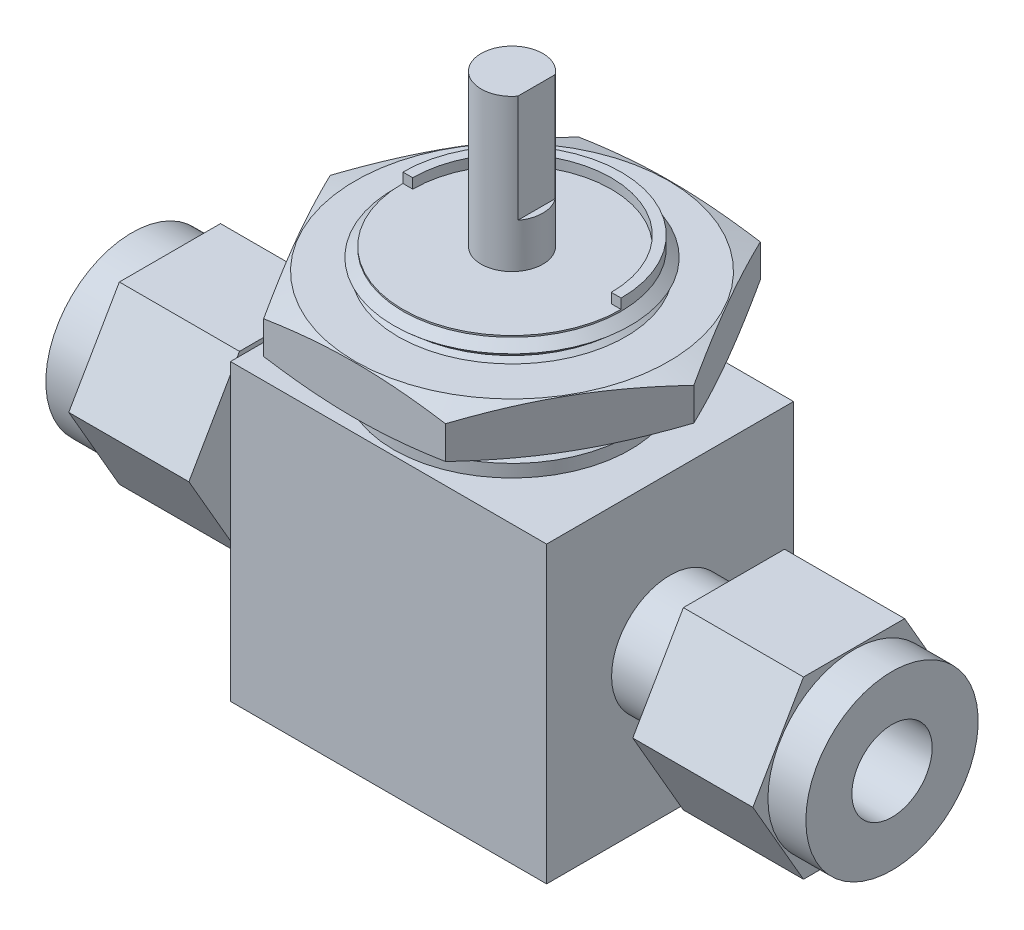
ISO-10303-21;
HEADER;
FILE_DESCRIPTION(('STEP AP214'),'2;1');
FILE_NAME('part.step','',(''),(''),'','','');
FILE_SCHEMA(('AUTOMOTIVE_DESIGN { 1 0 10303 214 1 1 1 1 }'));
ENDSEC;
DATA;
#1=APPLICATION_CONTEXT('core data for automotive mechanical design processes');
#2=APPLICATION_PROTOCOL_DEFINITION('international standard','automotive_design',2000,#1);
#3=PRODUCT_CONTEXT('',#1,'mechanical');
#4=PRODUCT('Part','Part','',(#3));
#5=PRODUCT_RELATED_PRODUCT_CATEGORY('part','',(#4));
#6=PRODUCT_DEFINITION_FORMATION('','',#4);
#7=PRODUCT_DEFINITION_CONTEXT('part definition',#1,'design');
#8=PRODUCT_DEFINITION('design','',#6,#7);
#9=PRODUCT_DEFINITION_SHAPE('','',#8);
#10=(LENGTH_UNIT() NAMED_UNIT(*) SI_UNIT(.MILLI.,.METRE.));
#11=(NAMED_UNIT(*) PLANE_ANGLE_UNIT() SI_UNIT($,.RADIAN.));
#12=(NAMED_UNIT(*) SI_UNIT($,.STERADIAN.) SOLID_ANGLE_UNIT());
#13=UNCERTAINTY_MEASURE_WITH_UNIT(LENGTH_MEASURE(1.E-05),#10,'distance_accuracy_value','');
#14=(GEOMETRIC_REPRESENTATION_CONTEXT(3) GLOBAL_UNCERTAINTY_ASSIGNED_CONTEXT((#13)) GLOBAL_UNIT_ASSIGNED_CONTEXT((#10,
#11,#12)) REPRESENTATION_CONTEXT('',''));
#15=CARTESIAN_POINT('',(0.,0.,0.));
#16=DIRECTION('',(0.,0.,1.));
#17=DIRECTION('',(1.,0.,0.));
#18=AXIS2_PLACEMENT_3D('',#15,#16,#17);
#19=CARTESIAN_POINT('',(0.,16.0147,0.));
#20=DIRECTION('',(0.,-1.,0.));
#21=DIRECTION('',(0.,0.,-1.));
#22=AXIS2_PLACEMENT_3D('',#19,#20,#21);
#23=CONICAL_SURFACE('',#22,8.76935,0.855052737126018);
#24=CARTESIAN_POINT('',(0.,15.3797,0.));
#25=DIRECTION('',(0.,-1.,0.));
#26=DIRECTION('',(0.,0.,-1.));
#27=AXIS2_PLACEMENT_3D('',#24,#25,#26);
#28=CIRCLE('',#27,9.4996);
#29=CARTESIAN_POINT('',(0.,15.3797,-9.4996));
#30=VERTEX_POINT('',#29);
#31=EDGE_CURVE('E628',#30,#30,#28,.T.);
#32=ORIENTED_EDGE('',*,*,#31,.F.);
#33=EDGE_LOOP('',(#32));
#34=FACE_BOUND('',#33,.T.);
#35=CARTESIAN_POINT('',(0.,15.592707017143,0.));
#36=DIRECTION('',(0.,1.,0.));
#37=DIRECTION('',(0.,0.,1.));
#38=AXIS2_PLACEMENT_3D('',#35,#36,#37);
#39=CIRCLE('',#38,9.25464193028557);
#40=CARTESIAN_POINT('',(0.,15.592707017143,9.25464193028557));
#41=VERTEX_POINT('',#40);
#42=EDGE_CURVE('E11',#41,#41,#39,.T.);
#43=ORIENTED_EDGE('',*,*,#42,.F.);
#44=EDGE_LOOP('',(#43));
#45=FACE_BOUND('',#44,.T.);
#46=ADVANCED_FACE('F36',(#34,#45),#23,.T.);
#47=CARTESIAN_POINT('',(-12.7,11.8237,9.9187));
#48=DIRECTION('',(0.,1.,0.));
#49=DIRECTION('',(0.,0.,1.));
#50=AXIS2_PLACEMENT_3D('',#47,#48,#49);
#51=PLANE('',#50);
#52=DIRECTION('',(0.,0.,-1.));
#53=VECTOR('',#52,1.);
#54=CARTESIAN_POINT('',(12.7,11.8237,9.9187));
#55=LINE('',#54,#53);
#56=CARTESIAN_POINT('',(12.7,11.8237,9.9187));
#57=VERTEX_POINT('',#56);
#58=CARTESIAN_POINT('',(12.7,11.8237,-9.9187));
#59=VERTEX_POINT('',#58);
#60=EDGE_CURVE('E590',#57,#59,#55,.T.);
#61=ORIENTED_EDGE('',*,*,#60,.T.);
#62=DIRECTION('',(1.,0.,0.));
#63=VECTOR('',#62,1.);
#64=CARTESIAN_POINT('',(-12.7,11.8237,-9.9187));
#65=LINE('',#64,#63);
#66=CARTESIAN_POINT('',(-12.7,11.8237,-9.9187));
#67=VERTEX_POINT('',#66);
#68=EDGE_CURVE('E579',#67,#59,#65,.T.);
#69=ORIENTED_EDGE('',*,*,#68,.F.);
#70=DIRECTION('',(0.,0.,-1.));
#71=VECTOR('',#70,1.);
#72=CARTESIAN_POINT('',(-12.7,11.8237,9.9187));
#73=LINE('',#72,#71);
#74=CARTESIAN_POINT('',(-12.7,11.8237,9.9187));
#75=VERTEX_POINT('',#74);
#76=EDGE_CURVE('E569',#75,#67,#73,.T.);
#77=ORIENTED_EDGE('',*,*,#76,.F.);
#78=DIRECTION('',(1.,0.,0.));
#79=VECTOR('',#78,1.);
#80=CARTESIAN_POINT('',(-12.7,11.8237,9.9187));
#81=LINE('',#80,#79);
#82=EDGE_CURVE('E586',#75,#57,#81,.T.);
#83=ORIENTED_EDGE('',*,*,#82,.T.);
#84=EDGE_LOOP('',(#61,#69,#77,#83));
#85=FACE_BOUND('',#84,.T.);
#86=CARTESIAN_POINT('',(0.,11.8237,0.));
#87=DIRECTION('',(0.,1.,0.));
#88=DIRECTION('',(0.,0.,1.));
#89=AXIS2_PLACEMENT_3D('',#86,#87,#88);
#90=CIRCLE('',#89,9.4996);
#91=CARTESIAN_POINT('',(0.,11.8237,9.4996));
#92=VERTEX_POINT('',#91);
#93=EDGE_CURVE('E601',#92,#92,#90,.T.);
#94=ORIENTED_EDGE('',*,*,#93,.F.);
#95=EDGE_LOOP('',(#94));
#96=FACE_BOUND('',#95,.T.);
#97=ADVANCED_FACE('F394',(#85,#96),#51,.T.);
#98=CARTESIAN_POINT('',(-30.5308,0.,0.));
#99=DIRECTION('',(-1.,0.,0.));
#100=DIRECTION('',(0.,0.,-1.));
#101=AXIS2_PLACEMENT_3D('',#98,#99,#100);
#102=PLANE('',#101);
#103=CARTESIAN_POINT('',(-30.5308,0.,0.));
#104=DIRECTION('',(1.,0.,0.));
#105=DIRECTION('',(0.,0.,-1.));
#106=AXIS2_PLACEMENT_3D('',#103,#104,#105);
#107=CIRCLE('',#106,6.9215);
#108=CARTESIAN_POINT('',(-30.5308,0.,-6.9215));
#109=VERTEX_POINT('',#108);
#110=EDGE_CURVE('E648',#109,#109,#107,.T.);
#111=ORIENTED_EDGE('',*,*,#110,.F.);
#112=EDGE_LOOP('',(#111));
#113=FACE_BOUND('',#112,.T.);
#114=CARTESIAN_POINT('',(-30.5308,0.,0.));
#115=DIRECTION('',(1.,0.,0.));
#116=DIRECTION('',(0.,0.,-1.));
#117=AXIS2_PLACEMENT_3D('',#114,#115,#116);
#118=CIRCLE('',#117,3.2258);
#119=CARTESIAN_POINT('',(-30.5308,0.,-3.2258));
#120=VERTEX_POINT('',#119);
#121=EDGE_CURVE('E644',#120,#120,#118,.T.);
#122=ORIENTED_EDGE('',*,*,#121,.T.);
#123=EDGE_LOOP('',(#122));
#124=FACE_BOUND('',#123,.T.);
#125=ADVANCED_FACE('F432',(#113,#124),#102,.T.);
#126=CARTESIAN_POINT('',(27.4828,7.03905448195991,-12.192));
#127=DIRECTION('',(1.,0.,0.));
#128=DIRECTION('',(0.,0.,-1.));
#129=AXIS2_PLACEMENT_3D('',#126,#127,#128);
#130=PLANE('',#129);
#131=DIRECTION('',(0.,-0.866025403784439,0.5));
#132=VECTOR('',#131,1.);
#133=CARTESIAN_POINT('',(27.4828,0.,-8.128));
#134=LINE('',#133,#132);
#135=CARTESIAN_POINT('',(27.4828,0.,-8.128));
#136=VERTEX_POINT('',#135);
#137=CARTESIAN_POINT('',(27.4828,-7.03905448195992,-4.064));
#138=VERTEX_POINT('',#137);
#139=EDGE_CURVE('E716',#136,#138,#134,.T.);
#140=ORIENTED_EDGE('',*,*,#139,.F.);
#141=DIRECTION('',(0.,-0.866025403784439,-0.5));
#142=VECTOR('',#141,1.);
#143=CARTESIAN_POINT('',(27.4828,7.03905448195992,-4.064));
#144=LINE('',#143,#142);
#145=CARTESIAN_POINT('',(27.4828,7.03905448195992,-4.064));
#146=VERTEX_POINT('',#145);
#147=EDGE_CURVE('E732',#146,#136,#144,.T.);
#148=ORIENTED_EDGE('',*,*,#147,.F.);
#149=DIRECTION('',(0.,0.,-1.));
#150=VECTOR('',#149,1.);
#151=CARTESIAN_POINT('',(27.4828,7.03905448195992,4.064));
#152=LINE('',#151,#150);
#153=CARTESIAN_POINT('',(27.4828,7.03905448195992,4.064));
#154=VERTEX_POINT('',#153);
#155=EDGE_CURVE('E729',#154,#146,#152,.T.);
#156=ORIENTED_EDGE('',*,*,#155,.F.);
#157=DIRECTION('',(0.,0.866025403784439,-0.5));
#158=VECTOR('',#157,1.);
#159=CARTESIAN_POINT('',(27.4828,0.,8.128));
#160=LINE('',#159,#158);
#161=CARTESIAN_POINT('',(27.4828,0.,8.128));
#162=VERTEX_POINT('',#161);
#163=EDGE_CURVE('E726',#162,#154,#160,.T.);
#164=ORIENTED_EDGE('',*,*,#163,.F.);
#165=DIRECTION('',(0.,0.866025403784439,0.5));
#166=VECTOR('',#165,1.);
#167=CARTESIAN_POINT('',(27.4828,-7.03905448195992,4.064));
#168=LINE('',#167,#166);
#169=CARTESIAN_POINT('',(27.4828,-7.03905448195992,4.064));
#170=VERTEX_POINT('',#169);
#171=EDGE_CURVE('E723',#170,#162,#168,.T.);
#172=ORIENTED_EDGE('',*,*,#171,.F.);
#173=DIRECTION('',(0.,0.,1.));
#174=VECTOR('',#173,1.);
#175=CARTESIAN_POINT('',(27.4828,-7.03905448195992,-4.064));
#176=LINE('',#175,#174);
#177=EDGE_CURVE('E719',#138,#170,#176,.T.);
#178=ORIENTED_EDGE('',*,*,#177,.F.);
#179=EDGE_LOOP('',(#140,#148,#156,#164,#172,#178));
#180=FACE_BOUND('',#179,.T.);
#181=CARTESIAN_POINT('',(27.4828,0.,0.));
#182=DIRECTION('',(1.,0.,0.));
#183=DIRECTION('',(0.,0.,-1.));
#184=AXIS2_PLACEMENT_3D('',#181,#182,#183);
#185=CIRCLE('',#184,6.9215);
#186=CARTESIAN_POINT('',(27.4828,0.,6.9215));
#187=VERTEX_POINT('',#186);
#188=EDGE_CURVE('E707',#187,#187,#185,.T.);
#189=ORIENTED_EDGE('',*,*,#188,.F.);
#190=EDGE_LOOP('',(#189));
#191=FACE_BOUND('',#190,.T.);
#192=ADVANCED_FACE('F435',(#180,#191),#130,.T.);
#193=CARTESIAN_POINT('',(12.7,-11.8237,9.9187));
#194=DIRECTION('',(-1.,0.,0.));
#195=DIRECTION('',(0.,0.,1.));
#196=AXIS2_PLACEMENT_3D('',#193,#194,#195);
#197=PLANE('',#196);
#198=DIRECTION('',(0.,0.,-1.));
#199=VECTOR('',#198,1.);
#200=CARTESIAN_POINT('',(12.7,-11.8237,9.9187));
#201=LINE('',#200,#199);
#202=CARTESIAN_POINT('',(12.7,-11.8237,9.9187));
#203=VERTEX_POINT('',#202);
#204=CARTESIAN_POINT('',(12.7,-11.8237,-9.9187));
#205=VERTEX_POINT('',#204);
#206=EDGE_CURVE('E561',#203,#205,#201,.T.);
#207=ORIENTED_EDGE('',*,*,#206,.T.);
#208=DIRECTION('',(0.,1.,0.));
#209=VECTOR('',#208,1.);
#210=CARTESIAN_POINT('',(12.7,-11.8237,-9.9187));
#211=LINE('',#210,#209);
#212=EDGE_CURVE('E567',#205,#59,#211,.T.);
#213=ORIENTED_EDGE('',*,*,#212,.T.);
#214=ORIENTED_EDGE('',*,*,#60,.F.);
#215=DIRECTION('',(0.,1.,0.));
#216=VECTOR('',#215,1.);
#217=CARTESIAN_POINT('',(12.7,-11.8237,9.9187));
#218=LINE('',#217,#216);
#219=EDGE_CURVE('E584',#203,#57,#218,.T.);
#220=ORIENTED_EDGE('',*,*,#219,.F.);
#221=EDGE_LOOP('',(#207,#213,#214,#220));
#222=FACE_BOUND('',#221,.T.);
#223=CARTESIAN_POINT('',(12.7,0.,0.));
#224=DIRECTION('',(-1.,0.,0.));
#225=DIRECTION('',(0.,0.,1.));
#226=AXIS2_PLACEMENT_3D('',#223,#224,#225);
#227=CIRCLE('',#226,4.699);
#228=CARTESIAN_POINT('',(12.7,0.,4.699));
#229=VERTEX_POINT('',#228);
#230=EDGE_CURVE('E560',#229,#229,#227,.F.);
#231=ORIENTED_EDGE('',*,*,#230,.F.);
#232=EDGE_LOOP('',(#231));
#233=FACE_BOUND('',#232,.T.);
#234=ADVANCED_FACE('F495',(#222,#233),#197,.F.);
#235=CARTESIAN_POINT('',(-12.7,11.8237,9.9187));
#236=DIRECTION('',(1.,0.,0.));
#237=DIRECTION('',(0.,1.,0.));
#238=AXIS2_PLACEMENT_3D('',#235,#236,#237);
#239=PLANE('',#238);
#240=CARTESIAN_POINT('',(-12.7,0.,0.));
#241=DIRECTION('',(1.,0.,0.));
#242=DIRECTION('',(0.,0.,-1.));
#243=AXIS2_PLACEMENT_3D('',#240,#241,#242);
#244=CIRCLE('',#243,4.699);
#245=CARTESIAN_POINT('',(-12.7,0.,-4.699));
#246=VERTEX_POINT('',#245);
#247=EDGE_CURVE('E700',#246,#246,#244,.T.);
#248=ORIENTED_EDGE('',*,*,#247,.T.);
#249=EDGE_LOOP('',(#248));
#250=FACE_BOUND('',#249,.T.);
#251=ORIENTED_EDGE('',*,*,#76,.T.);
#252=DIRECTION('',(0.,-1.,0.));
#253=VECTOR('',#252,1.);
#254=CARTESIAN_POINT('',(-12.7,11.8237,-9.9187));
#255=LINE('',#254,#253);
#256=CARTESIAN_POINT('',(-12.7,-11.8237,-9.9187));
#257=VERTEX_POINT('',#256);
#258=EDGE_CURVE('E565',#67,#257,#255,.T.);
#259=ORIENTED_EDGE('',*,*,#258,.T.);
#260=DIRECTION('',(0.,0.,-1.));
#261=VECTOR('',#260,1.);
#262=CARTESIAN_POINT('',(-12.7,-11.8237,9.9187));
#263=LINE('',#262,#261);
#264=CARTESIAN_POINT('',(-12.7,-11.8237,9.9187));
#265=VERTEX_POINT('',#264);
#266=EDGE_CURVE('E551',#265,#257,#263,.T.);
#267=ORIENTED_EDGE('',*,*,#266,.F.);
#268=DIRECTION('',(0.,-1.,0.));
#269=VECTOR('',#268,1.);
#270=CARTESIAN_POINT('',(-12.7,11.8237,9.9187));
#271=LINE('',#270,#269);
#272=EDGE_CURVE('E581',#75,#265,#271,.T.);
#273=ORIENTED_EDGE('',*,*,#272,.F.);
#274=EDGE_LOOP('',(#251,#259,#267,#273));
#275=FACE_BOUND('',#274,.T.);
#276=ADVANCED_FACE('F38',(#250,#275),#239,.F.);
#277=CARTESIAN_POINT('',(12.7,-11.8237,9.9187));
#278=DIRECTION('',(0.,-1.,0.));
#279=DIRECTION('',(1.,0.,0.));
#280=AXIS2_PLACEMENT_3D('',#277,#278,#279);
#281=PLANE('',#280);
#282=ORIENTED_EDGE('',*,*,#266,.T.);
#283=DIRECTION('',(-1.,0.,0.));
#284=VECTOR('',#283,1.);
#285=CARTESIAN_POINT('',(12.7,-11.8237,-9.9187));
#286=LINE('',#285,#284);
#287=EDGE_CURVE('E553',#205,#257,#286,.T.);
#288=ORIENTED_EDGE('',*,*,#287,.F.);
#289=ORIENTED_EDGE('',*,*,#206,.F.);
#290=DIRECTION('',(-1.,0.,0.));
#291=VECTOR('',#290,1.);
#292=CARTESIAN_POINT('',(12.7,-11.8237,9.9187));
#293=LINE('',#292,#291);
#294=EDGE_CURVE('E556',#203,#265,#293,.T.);
#295=ORIENTED_EDGE('',*,*,#294,.T.);
#296=EDGE_LOOP('',(#282,#288,#289,#295));
#297=FACE_BOUND('',#296,.T.);
#298=ADVANCED_FACE('F535',(#297),#281,.T.);
#299=CARTESIAN_POINT('',(-12.7,-11.8237,9.9187));
#300=DIRECTION('',(0.,0.,-1.));
#301=DIRECTION('',(-1.,0.,0.));
#302=AXIS2_PLACEMENT_3D('',#299,#300,#301);
#303=PLANE('',#302);
#304=ORIENTED_EDGE('',*,*,#272,.T.);
#305=ORIENTED_EDGE('',*,*,#294,.F.);
#306=ORIENTED_EDGE('',*,*,#219,.T.);
#307=ORIENTED_EDGE('',*,*,#82,.F.);
#308=EDGE_LOOP('',(#304,#305,#306,#307));
#309=FACE_BOUND('',#308,.T.);
#310=ADVANCED_FACE('F531',(#309),#303,.F.);
#311=CARTESIAN_POINT('',(-12.7,-11.8237,-9.9187));
#312=DIRECTION('',(0.,0.,-1.));
#313=DIRECTION('',(-1.,0.,0.));
#314=AXIS2_PLACEMENT_3D('',#311,#312,#313);
#315=PLANE('',#314);
#316=ORIENTED_EDGE('',*,*,#258,.F.);
#317=ORIENTED_EDGE('',*,*,#68,.T.);
#318=ORIENTED_EDGE('',*,*,#212,.F.);
#319=ORIENTED_EDGE('',*,*,#287,.T.);
#320=EDGE_LOOP('',(#316,#317,#318,#319));
#321=FACE_BOUND('',#320,.T.);
#322=ADVANCED_FACE('F527',(#321),#315,.T.);
#323=CARTESIAN_POINT('',(17.8308,0.,0.));
#324=DIRECTION('',(-1.,0.,0.));
#325=DIRECTION('',(0.,0.,1.));
#326=AXIS2_PLACEMENT_3D('',#323,#324,#325);
#327=CYLINDRICAL_SURFACE('',#326,4.699);
#328=CARTESIAN_POINT('',(17.8308,0.,0.));
#329=DIRECTION('',(1.,0.,0.));
#330=DIRECTION('',(0.,0.,-1.));
#331=AXIS2_PLACEMENT_3D('',#328,#329,#330);
#332=CIRCLE('',#331,4.699);
#333=CARTESIAN_POINT('',(17.8308,0.,-4.699));
#334=VERTEX_POINT('',#333);
#335=EDGE_CURVE('E571',#334,#334,#332,.T.);
#336=ORIENTED_EDGE('',*,*,#335,.F.);
#337=EDGE_LOOP('',(#336));
#338=FACE_BOUND('',#337,.T.);
#339=ORIENTED_EDGE('',*,*,#230,.T.);
#340=EDGE_LOOP('',(#339));
#341=FACE_BOUND('',#340,.T.);
#342=ADVANCED_FACE('F501',(#338,#341),#327,.T.);
#343=CARTESIAN_POINT('',(17.8308,7.03905448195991,-12.192));
#344=DIRECTION('',(1.,0.,0.));
#345=DIRECTION('',(0.,0.,-1.));
#346=AXIS2_PLACEMENT_3D('',#343,#344,#345);
#347=PLANE('',#346);
#348=DIRECTION('',(0.,-0.866025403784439,0.5));
#349=VECTOR('',#348,1.);
#350=CARTESIAN_POINT('',(17.8308,0.,-8.128));
#351=LINE('',#350,#349);
#352=CARTESIAN_POINT('',(17.8308,0.,-8.128));
#353=VERTEX_POINT('',#352);
#354=CARTESIAN_POINT('',(17.8308,-7.03905448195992,-4.064));
#355=VERTEX_POINT('',#354);
#356=EDGE_CURVE('E713',#353,#355,#351,.T.);
#357=ORIENTED_EDGE('',*,*,#356,.T.);
#358=DIRECTION('',(0.,0.,1.));
#359=VECTOR('',#358,1.);
#360=CARTESIAN_POINT('',(17.8308,-7.03905448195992,-4.064));
#361=LINE('',#360,#359);
#362=CARTESIAN_POINT('',(17.8308,-7.03905448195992,4.064));
#363=VERTEX_POINT('',#362);
#364=EDGE_CURVE('E738',#355,#363,#361,.T.);
#365=ORIENTED_EDGE('',*,*,#364,.T.);
#366=DIRECTION('',(0.,0.866025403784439,0.5));
#367=VECTOR('',#366,1.);
#368=CARTESIAN_POINT('',(17.8308,-7.03905448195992,4.064));
#369=LINE('',#368,#367);
#370=CARTESIAN_POINT('',(17.8308,0.,8.128));
#371=VERTEX_POINT('',#370);
#372=EDGE_CURVE('E741',#363,#371,#369,.T.);
#373=ORIENTED_EDGE('',*,*,#372,.T.);
#374=DIRECTION('',(0.,0.866025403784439,-0.5));
#375=VECTOR('',#374,1.);
#376=CARTESIAN_POINT('',(17.8308,0.,8.128));
#377=LINE('',#376,#375);
#378=CARTESIAN_POINT('',(17.8308,7.03905448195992,4.064));
#379=VERTEX_POINT('',#378);
#380=EDGE_CURVE('E744',#371,#379,#377,.T.);
#381=ORIENTED_EDGE('',*,*,#380,.T.);
#382=DIRECTION('',(0.,0.,-1.));
#383=VECTOR('',#382,1.);
#384=CARTESIAN_POINT('',(17.8308,7.03905448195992,4.064));
#385=LINE('',#384,#383);
#386=CARTESIAN_POINT('',(17.8308,7.03905448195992,-4.064));
#387=VERTEX_POINT('',#386);
#388=EDGE_CURVE('E747',#379,#387,#385,.T.);
#389=ORIENTED_EDGE('',*,*,#388,.T.);
#390=DIRECTION('',(0.,-0.866025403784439,-0.5));
#391=VECTOR('',#390,1.);
#392=CARTESIAN_POINT('',(17.8308,7.03905448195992,-4.064));
#393=LINE('',#392,#391);
#394=EDGE_CURVE('E720',#387,#353,#393,.T.);
#395=ORIENTED_EDGE('',*,*,#394,.T.);
#396=EDGE_LOOP('',(#357,#365,#373,#381,#389,#395));
#397=FACE_BOUND('',#396,.T.);
#398=ORIENTED_EDGE('',*,*,#335,.T.);
#399=EDGE_LOOP('',(#398));
#400=FACE_BOUND('',#399,.T.);
#401=ADVANCED_FACE('F497',(#397,#400),#347,.F.);
#402=CARTESIAN_POINT('',(27.4828,0.,-8.128));
#403=DIRECTION('',(0.,-0.5,-0.866025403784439));
#404=DIRECTION('',(0.,0.866025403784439,-0.5));
#405=AXIS2_PLACEMENT_3D('',#402,#403,#404);
#406=PLANE('',#405);
#407=ORIENTED_EDGE('',*,*,#356,.F.);
#408=DIRECTION('',(-1.,0.,0.));
#409=VECTOR('',#408,1.);
#410=CARTESIAN_POINT('',(27.4828,0.,-8.128));
#411=LINE('',#410,#409);
#412=EDGE_CURVE('E574',#136,#353,#411,.T.);
#413=ORIENTED_EDGE('',*,*,#412,.F.);
#414=ORIENTED_EDGE('',*,*,#139,.T.);
#415=DIRECTION('',(-1.,0.,0.));
#416=VECTOR('',#415,1.);
#417=CARTESIAN_POINT('',(27.4828,-7.03905448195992,-4.064));
#418=LINE('',#417,#416);
#419=EDGE_CURVE('E735',#138,#355,#418,.T.);
#420=ORIENTED_EDGE('',*,*,#419,.T.);
#421=EDGE_LOOP('',(#407,#413,#414,#420));
#422=FACE_BOUND('',#421,.T.);
#423=ADVANCED_FACE('F500',(#422),#406,.T.);
#424=CARTESIAN_POINT('',(27.4828,7.03905448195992,-4.064));
#425=DIRECTION('',(0.,0.5,-0.866025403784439));
#426=DIRECTION('',(0.,0.866025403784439,0.5));
#427=AXIS2_PLACEMENT_3D('',#424,#425,#426);
#428=PLANE('',#427);
#429=ORIENTED_EDGE('',*,*,#394,.F.);
#430=DIRECTION('',(-1.,0.,0.));
#431=VECTOR('',#430,1.);
#432=CARTESIAN_POINT('',(27.4828,7.03905448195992,-4.064));
#433=LINE('',#432,#431);
#434=EDGE_CURVE('E753',#146,#387,#433,.T.);
#435=ORIENTED_EDGE('',*,*,#434,.F.);
#436=ORIENTED_EDGE('',*,*,#147,.T.);
#437=ORIENTED_EDGE('',*,*,#412,.T.);
#438=EDGE_LOOP('',(#429,#435,#436,#437));
#439=FACE_BOUND('',#438,.T.);
#440=ADVANCED_FACE('F503',(#439),#428,.T.);
#441=CARTESIAN_POINT('',(27.4828,7.03905448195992,4.064));
#442=DIRECTION('',(0.,1.,0.));
#443=DIRECTION('',(0.,0.,1.));
#444=AXIS2_PLACEMENT_3D('',#441,#442,#443);
#445=PLANE('',#444);
#446=ORIENTED_EDGE('',*,*,#388,.F.);
#447=DIRECTION('',(-1.,0.,0.));
#448=VECTOR('',#447,1.);
#449=CARTESIAN_POINT('',(27.4828,7.03905448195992,4.064));
#450=LINE('',#449,#448);
#451=EDGE_CURVE('E755',#154,#379,#450,.T.);
#452=ORIENTED_EDGE('',*,*,#451,.F.);
#453=ORIENTED_EDGE('',*,*,#155,.T.);
#454=ORIENTED_EDGE('',*,*,#434,.T.);
#455=EDGE_LOOP('',(#446,#452,#453,#454));
#456=FACE_BOUND('',#455,.T.);
#457=ADVANCED_FACE('F506',(#456),#445,.T.);
#458=CARTESIAN_POINT('',(27.4828,0.,8.128));
#459=DIRECTION('',(0.,0.5,0.866025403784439));
#460=DIRECTION('',(0.,-0.866025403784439,0.5));
#461=AXIS2_PLACEMENT_3D('',#458,#459,#460);
#462=PLANE('',#461);
#463=ORIENTED_EDGE('',*,*,#380,.F.);
#464=DIRECTION('',(-1.,0.,0.));
#465=VECTOR('',#464,1.);
#466=CARTESIAN_POINT('',(27.4828,0.,8.128));
#467=LINE('',#466,#465);
#468=EDGE_CURVE('E757',#162,#371,#467,.T.);
#469=ORIENTED_EDGE('',*,*,#468,.F.);
#470=ORIENTED_EDGE('',*,*,#163,.T.);
#471=ORIENTED_EDGE('',*,*,#451,.T.);
#472=EDGE_LOOP('',(#463,#469,#470,#471));
#473=FACE_BOUND('',#472,.T.);
#474=ADVANCED_FACE('F510',(#473),#462,.T.);
#475=CARTESIAN_POINT('',(27.4828,-7.03905448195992,4.064));
#476=DIRECTION('',(0.,-0.5,0.866025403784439));
#477=DIRECTION('',(0.,-0.866025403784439,-0.5));
#478=AXIS2_PLACEMENT_3D('',#475,#476,#477);
#479=PLANE('',#478);
#480=ORIENTED_EDGE('',*,*,#372,.F.);
#481=DIRECTION('',(-1.,0.,0.));
#482=VECTOR('',#481,1.);
#483=CARTESIAN_POINT('',(27.4828,-7.03905448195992,4.064));
#484=LINE('',#483,#482);
#485=EDGE_CURVE('E759',#170,#363,#484,.T.);
#486=ORIENTED_EDGE('',*,*,#485,.F.);
#487=ORIENTED_EDGE('',*,*,#171,.T.);
#488=ORIENTED_EDGE('',*,*,#468,.T.);
#489=EDGE_LOOP('',(#480,#486,#487,#488));
#490=FACE_BOUND('',#489,.T.);
#491=ADVANCED_FACE('F514',(#490),#479,.T.);
#492=CARTESIAN_POINT('',(27.4828,-7.03905448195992,-4.064));
#493=DIRECTION('',(0.,-1.,0.));
#494=DIRECTION('',(0.,0.,-1.));
#495=AXIS2_PLACEMENT_3D('',#492,#493,#494);
#496=PLANE('',#495);
#497=ORIENTED_EDGE('',*,*,#364,.F.);
#498=ORIENTED_EDGE('',*,*,#419,.F.);
#499=ORIENTED_EDGE('',*,*,#177,.T.);
#500=ORIENTED_EDGE('',*,*,#485,.T.);
#501=EDGE_LOOP('',(#497,#498,#499,#500));
#502=FACE_BOUND('',#501,.T.);
#503=ADVANCED_FACE('F491',(#502),#496,.T.);
#504=CARTESIAN_POINT('',(30.5308,0.,0.));
#505=DIRECTION('',(-1.,0.,0.));
#506=DIRECTION('',(0.,0.,1.));
#507=AXIS2_PLACEMENT_3D('',#504,#505,#506);
#508=CYLINDRICAL_SURFACE('',#507,6.9215);
#509=CARTESIAN_POINT('',(30.5308,0.,0.));
#510=DIRECTION('',(1.,0.,0.));
#511=DIRECTION('',(0.,0.,-1.));
#512=AXIS2_PLACEMENT_3D('',#509,#510,#511);
#513=CIRCLE('',#512,6.9215);
#514=CARTESIAN_POINT('',(30.5308,0.,6.9215));
#515=VERTEX_POINT('',#514);
#516=EDGE_CURVE('E710',#515,#515,#513,.T.);
#517=CARTESIAN_POINT('',(30.5308,0.,6.9215));
#518=CARTESIAN_POINT('',(30.49905,0.,6.9215));
#519=CARTESIAN_POINT('',(30.4673,0.,6.9215));
#520=CARTESIAN_POINT('',(30.4038,0.,6.9215));
#521=CARTESIAN_POINT('',(30.37205,0.,6.9215));
#522=CARTESIAN_POINT('',(30.30855,0.,6.9215));
#523=CARTESIAN_POINT('',(30.2768,0.,6.9215));
#524=CARTESIAN_POINT('',(30.2133,0.,6.9215));
#525=CARTESIAN_POINT('',(30.18155,0.,6.9215));
#526=CARTESIAN_POINT('',(30.11805,0.,6.9215));
#527=CARTESIAN_POINT('',(30.0863,0.,6.9215));
#528=CARTESIAN_POINT('',(30.0228,0.,6.9215));
#529=CARTESIAN_POINT('',(29.99105,0.,6.9215));
#530=CARTESIAN_POINT('',(29.92755,0.,6.9215));
#531=CARTESIAN_POINT('',(29.8958,0.,6.9215));
#532=CARTESIAN_POINT('',(29.8323,0.,6.9215));
#533=CARTESIAN_POINT('',(29.80055,0.,6.9215));
#534=CARTESIAN_POINT('',(29.73705,0.,6.9215));
#535=CARTESIAN_POINT('',(29.7053,0.,6.9215));
#536=CARTESIAN_POINT('',(29.6418,0.,6.9215));
#537=CARTESIAN_POINT('',(29.61005,0.,6.9215));
#538=CARTESIAN_POINT('',(29.54655,0.,6.9215));
#539=CARTESIAN_POINT('',(29.5148,0.,6.9215));
#540=CARTESIAN_POINT('',(29.4513,0.,6.9215));
#541=CARTESIAN_POINT('',(29.41955,0.,6.9215));
#542=CARTESIAN_POINT('',(29.35605,0.,6.9215));
#543=CARTESIAN_POINT('',(29.3243,0.,6.9215));
#544=CARTESIAN_POINT('',(29.2608,0.,6.9215));
#545=CARTESIAN_POINT('',(29.22905,0.,6.9215));
#546=CARTESIAN_POINT('',(29.16555,0.,6.9215));
#547=CARTESIAN_POINT('',(29.1338,0.,6.9215));
#548=CARTESIAN_POINT('',(29.0703,0.,6.9215));
#549=CARTESIAN_POINT('',(29.03855,0.,6.9215));
#550=CARTESIAN_POINT('',(28.97505,0.,6.9215));
#551=CARTESIAN_POINT('',(28.9433,0.,6.9215));
#552=CARTESIAN_POINT('',(28.8798,0.,6.9215));
#553=CARTESIAN_POINT('',(28.84805,0.,6.9215));
#554=CARTESIAN_POINT('',(28.78455,0.,6.9215));
#555=CARTESIAN_POINT('',(28.7528,0.,6.9215));
#556=CARTESIAN_POINT('',(28.6893,0.,6.9215));
#557=CARTESIAN_POINT('',(28.65755,0.,6.9215));
#558=CARTESIAN_POINT('',(28.59405,0.,6.9215));
#559=CARTESIAN_POINT('',(28.5623,0.,6.9215));
#560=CARTESIAN_POINT('',(28.4988,0.,6.9215));
#561=CARTESIAN_POINT('',(28.46705,0.,6.9215));
#562=CARTESIAN_POINT('',(28.40355,0.,6.9215));
#563=CARTESIAN_POINT('',(28.3718,0.,6.9215));
#564=CARTESIAN_POINT('',(28.3083,0.,6.9215));
#565=CARTESIAN_POINT('',(28.27655,0.,6.9215));
#566=CARTESIAN_POINT('',(28.21305,0.,6.9215));
#567=CARTESIAN_POINT('',(28.1813,0.,6.9215));
#568=CARTESIAN_POINT('',(28.1178,0.,6.9215));
#569=CARTESIAN_POINT('',(28.08605,0.,6.9215));
#570=CARTESIAN_POINT('',(28.02255,0.,6.9215));
#571=CARTESIAN_POINT('',(27.9908,0.,6.9215));
#572=CARTESIAN_POINT('',(27.9273,0.,6.9215));
#573=CARTESIAN_POINT('',(27.89555,0.,6.9215));
#574=CARTESIAN_POINT('',(27.83205,0.,6.9215));
#575=CARTESIAN_POINT('',(27.8003,0.,6.9215));
#576=CARTESIAN_POINT('',(27.7368,0.,6.9215));
#577=CARTESIAN_POINT('',(27.70505,0.,6.9215));
#578=CARTESIAN_POINT('',(27.64155,0.,6.9215));
#579=CARTESIAN_POINT('',(27.6098,0.,6.9215));
#580=CARTESIAN_POINT('',(27.5463,0.,6.9215));
#581=CARTESIAN_POINT('',(27.51455,0.,6.9215));
#582=CARTESIAN_POINT('',(27.4828,0.,6.9215));
#583=B_SPLINE_CURVE_WITH_KNOTS('',3,(#517,#518,#519,#520,#521,#522,#523,#524,#525,#526,#527,
#528,#529,#530,#531,#532,#533,#534,#535,#536,#537,#538,#539,#540,#541,#542,#543,#544,#545,#546,
#547,#548,#549,#550,#551,#552,#553,#554,#555,#556,#557,#558,#559,#560,#561,#562,#563,#564,#565,
#566,#567,#568,#569,#570,#571,#572,#573,#574,#575,#576,#577,#578,#579,#580,#581,#582),
.UNSPECIFIED.,.F.,.F.,(4,2,2,2,2,2,2,2,2,2,2,2,2,2,2,2,2,2,2,2,2,2,2,2,2,2,2,2,2,2,2,2,4),(0.,
0.0952500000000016,0.190500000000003,0.285750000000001,0.381000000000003,0.476250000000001,
0.571500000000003,0.666750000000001,0.762000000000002,0.85725,0.952500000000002,1.04775,1.143,
1.23825,1.3335,1.42875,1.524,1.61925,1.7145,1.80975,1.905,2.00025,2.0955,2.19075,2.286,2.38125,
2.4765,2.57175,2.667,2.76225,2.8575,2.95275,3.048),.UNSPECIFIED.);
#584=EDGE_CURVE('BSEAM487',#515,#187,#583,.T.);
#585=ORIENTED_EDGE('',*,*,#516,.F.);
#586=ORIENTED_EDGE('',*,*,#188,.T.);
#587=ORIENTED_EDGE('',*,*,#584,.T.);
#588=ORIENTED_EDGE('',*,*,#584,.F.);
#589=EDGE_LOOP('',(#585,#587,#586,#588));
#590=FACE_BOUND('',#589,.T.);
#591=ADVANCED_FACE('F487',(#590),#508,.T.);
#592=CARTESIAN_POINT('',(30.5308,0.,0.));
#593=DIRECTION('',(1.,0.,0.));
#594=DIRECTION('',(0.,0.,-1.));
#595=AXIS2_PLACEMENT_3D('',#592,#593,#594);
#596=PLANE('',#595);
#597=CARTESIAN_POINT('',(30.5308,0.,0.));
#598=DIRECTION('',(1.,0.,0.));
#599=DIRECTION('',(0.,0.,-1.));
#600=AXIS2_PLACEMENT_3D('',#597,#598,#599);
#601=CIRCLE('',#600,3.2258);
#602=CARTESIAN_POINT('',(30.5308,0.,-3.2258));
#603=VERTEX_POINT('',#602);
#604=EDGE_CURVE('E703',#603,#603,#601,.T.);
#605=ORIENTED_EDGE('',*,*,#604,.F.);
#606=EDGE_LOOP('',(#605));
#607=FACE_BOUND('',#606,.T.);
#608=ORIENTED_EDGE('',*,*,#516,.T.);
#609=EDGE_LOOP('',(#608));
#610=FACE_BOUND('',#609,.T.);
#611=ADVANCED_FACE('F483',(#607,#610),#596,.T.);
#612=CARTESIAN_POINT('',(15.24,0.,0.));
#613=DIRECTION('',(1.,0.,0.));
#614=DIRECTION('',(0.,0.,-1.));
#615=AXIS2_PLACEMENT_3D('',#612,#613,#614);
#616=CYLINDRICAL_SURFACE('',#615,3.2258);
#617=CARTESIAN_POINT('',(15.24,0.,0.));
#618=DIRECTION('',(1.,0.,0.));
#619=DIRECTION('',(0.,0.,-1.));
#620=AXIS2_PLACEMENT_3D('',#617,#618,#619);
#621=CIRCLE('',#620,3.2258);
#622=CARTESIAN_POINT('',(15.24,0.,-3.2258));
#623=VERTEX_POINT('',#622);
#624=EDGE_CURVE('E704',#623,#623,#621,.T.);
#625=ORIENTED_EDGE('',*,*,#624,.F.);
#626=EDGE_LOOP('',(#625));
#627=FACE_BOUND('',#626,.T.);
#628=ORIENTED_EDGE('',*,*,#604,.T.);
#629=EDGE_LOOP('',(#628));
#630=FACE_BOUND('',#629,.T.);
#631=ADVANCED_FACE('F479',(#627,#630),#616,.F.);
#632=CARTESIAN_POINT('',(15.24,0.,0.));
#633=DIRECTION('',(1.,0.,0.));
#634=DIRECTION('',(0.,0.,-1.));
#635=AXIS2_PLACEMENT_3D('',#632,#633,#634);
#636=PLANE('',#635);
#637=CARTESIAN_POINT('',(15.24,0.,0.));
#638=DIRECTION('',(1.,0.,0.));
#639=DIRECTION('',(0.,0.,-1.));
#640=AXIS2_PLACEMENT_3D('',#637,#638,#639);
#641=CIRCLE('',#640,2.3749);
#642=CARTESIAN_POINT('',(15.24,0.,-2.3749));
#643=VERTEX_POINT('',#642);
#644=EDGE_CURVE('E267',#643,#643,#641,.T.);
#645=ORIENTED_EDGE('',*,*,#644,.F.);
#646=EDGE_LOOP('',(#645));
#647=FACE_BOUND('',#646,.T.);
#648=ORIENTED_EDGE('',*,*,#624,.T.);
#649=EDGE_LOOP('',(#648));
#650=FACE_BOUND('',#649,.T.);
#651=ADVANCED_FACE('F475',(#647,#650),#636,.T.);
#652=CARTESIAN_POINT('',(-17.8308,0.,0.));
#653=DIRECTION('',(1.,0.,0.));
#654=DIRECTION('',(0.,0.,-1.));
#655=AXIS2_PLACEMENT_3D('',#652,#653,#654);
#656=CYLINDRICAL_SURFACE('',#655,4.699);
#657=CARTESIAN_POINT('',(-17.8308,0.,0.));
#658=DIRECTION('',(-1.,0.,0.));
#659=DIRECTION('',(0.,0.,1.));
#660=AXIS2_PLACEMENT_3D('',#657,#658,#659);
#661=CIRCLE('',#660,4.699);
#662=CARTESIAN_POINT('',(-17.8308,0.,4.699));
#663=VERTEX_POINT('',#662);
#664=EDGE_CURVE('E683',#663,#663,#661,.F.);
#665=ORIENTED_EDGE('',*,*,#664,.T.);
#666=EDGE_LOOP('',(#665));
#667=FACE_BOUND('',#666,.T.);
#668=ORIENTED_EDGE('',*,*,#247,.F.);
#669=EDGE_LOOP('',(#668));
#670=FACE_BOUND('',#669,.T.);
#671=ADVANCED_FACE('F471',(#667,#670),#656,.T.);
#672=CARTESIAN_POINT('',(-27.4828,0.,-8.128));
#673=DIRECTION('',(0.,0.5,0.866025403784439));
#674=DIRECTION('',(0.,-0.866025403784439,0.5));
#675=AXIS2_PLACEMENT_3D('',#672,#673,#674);
#676=PLANE('',#675);
#677=DIRECTION('',(0.,-0.866025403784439,0.5));
#678=VECTOR('',#677,1.);
#679=CARTESIAN_POINT('',(-17.8308,0.,-8.128));
#680=LINE('',#679,#678);
#681=CARTESIAN_POINT('',(-17.8308,0.,-8.128));
#682=VERTEX_POINT('',#681);
#683=CARTESIAN_POINT('',(-17.8308,-7.03905448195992,-4.064));
#684=VERTEX_POINT('',#683);
#685=EDGE_CURVE('E653',#682,#684,#680,.T.);
#686=ORIENTED_EDGE('',*,*,#685,.T.);
#687=DIRECTION('',(1.,0.,0.));
#688=VECTOR('',#687,1.);
#689=CARTESIAN_POINT('',(-27.4828,-7.03905448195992,-4.064));
#690=LINE('',#689,#688);
#691=CARTESIAN_POINT('',(-27.4828,-7.03905448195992,-4.064));
#692=VERTEX_POINT('',#691);
#693=EDGE_CURVE('E680',#692,#684,#690,.T.);
#694=ORIENTED_EDGE('',*,*,#693,.F.);
#695=DIRECTION('',(0.,-0.866025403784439,0.5));
#696=VECTOR('',#695,1.);
#697=CARTESIAN_POINT('',(-27.4828,0.,-8.128));
#698=LINE('',#697,#696);
#699=CARTESIAN_POINT('',(-27.4828,0.,-8.128));
#700=VERTEX_POINT('',#699);
#701=EDGE_CURVE('E654',#700,#692,#698,.T.);
#702=ORIENTED_EDGE('',*,*,#701,.F.);
#703=DIRECTION('',(1.,0.,0.));
#704=VECTOR('',#703,1.);
#705=CARTESIAN_POINT('',(-27.4828,0.,-8.128));
#706=LINE('',#705,#704);
#707=EDGE_CURVE('E668',#700,#682,#706,.T.);
#708=ORIENTED_EDGE('',*,*,#707,.T.);
#709=EDGE_LOOP('',(#686,#694,#702,#708));
#710=FACE_BOUND('',#709,.T.);
#711=ADVANCED_FACE('F453',(#710),#676,.F.);
#712=CARTESIAN_POINT('',(-27.4828,-7.03905448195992,-4.064));
#713=DIRECTION('',(0.,1.,0.));
#714=DIRECTION('',(0.,0.,1.));
#715=AXIS2_PLACEMENT_3D('',#712,#713,#714);
#716=PLANE('',#715);
#717=DIRECTION('',(0.,0.,1.));
#718=VECTOR('',#717,1.);
#719=CARTESIAN_POINT('',(-17.8308,-7.03905448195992,-4.064));
#720=LINE('',#719,#718);
#721=CARTESIAN_POINT('',(-17.8308,-7.03905448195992,4.064));
#722=VERTEX_POINT('',#721);
#723=EDGE_CURVE('E658',#684,#722,#720,.T.);
#724=ORIENTED_EDGE('',*,*,#723,.T.);
#725=DIRECTION('',(1.,0.,0.));
#726=VECTOR('',#725,1.);
#727=CARTESIAN_POINT('',(-27.4828,-7.03905448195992,4.064));
#728=LINE('',#727,#726);
#729=CARTESIAN_POINT('',(-27.4828,-7.03905448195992,4.064));
#730=VERTEX_POINT('',#729);
#731=EDGE_CURVE('E684',#730,#722,#728,.T.);
#732=ORIENTED_EDGE('',*,*,#731,.F.);
#733=DIRECTION('',(0.,0.,1.));
#734=VECTOR('',#733,1.);
#735=CARTESIAN_POINT('',(-27.4828,-7.03905448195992,-4.064));
#736=LINE('',#735,#734);
#737=EDGE_CURVE('E666',#692,#730,#736,.T.);
#738=ORIENTED_EDGE('',*,*,#737,.F.);
#739=ORIENTED_EDGE('',*,*,#693,.T.);
#740=EDGE_LOOP('',(#724,#732,#738,#739));
#741=FACE_BOUND('',#740,.T.);
#742=ADVANCED_FACE('F449',(#741),#716,.F.);
#743=CARTESIAN_POINT('',(-27.4828,-7.03905448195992,4.064));
#744=DIRECTION('',(0.,0.5,-0.866025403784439));
#745=DIRECTION('',(0.,0.866025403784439,0.5));
#746=AXIS2_PLACEMENT_3D('',#743,#744,#745);
#747=PLANE('',#746);
#748=DIRECTION('',(0.,0.866025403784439,0.5));
#749=VECTOR('',#748,1.);
#750=CARTESIAN_POINT('',(-17.8308,-7.03905448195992,4.064));
#751=LINE('',#750,#749);
#752=CARTESIAN_POINT('',(-17.8308,0.,8.128));
#753=VERTEX_POINT('',#752);
#754=EDGE_CURVE('E677',#722,#753,#751,.T.);
#755=ORIENTED_EDGE('',*,*,#754,.T.);
#756=DIRECTION('',(1.,0.,0.));
#757=VECTOR('',#756,1.);
#758=CARTESIAN_POINT('',(-27.4828,0.,8.128));
#759=LINE('',#758,#757);
#760=CARTESIAN_POINT('',(-27.4828,0.,8.128));
#761=VERTEX_POINT('',#760);
#762=EDGE_CURVE('E687',#761,#753,#759,.T.);
#763=ORIENTED_EDGE('',*,*,#762,.F.);
#764=DIRECTION('',(0.,0.866025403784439,0.5));
#765=VECTOR('',#764,1.);
#766=CARTESIAN_POINT('',(-27.4828,-7.03905448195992,4.064));
#767=LINE('',#766,#765);
#768=EDGE_CURVE('E664',#730,#761,#767,.T.);
#769=ORIENTED_EDGE('',*,*,#768,.F.);
#770=ORIENTED_EDGE('',*,*,#731,.T.);
#771=EDGE_LOOP('',(#755,#763,#769,#770));
#772=FACE_BOUND('',#771,.T.);
#773=ADVANCED_FACE('F452',(#772),#747,.F.);
#774=CARTESIAN_POINT('',(-27.4828,0.,8.128));
#775=DIRECTION('',(0.,-0.5,-0.866025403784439));
#776=DIRECTION('',(0.,0.866025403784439,-0.5));
#777=AXIS2_PLACEMENT_3D('',#774,#775,#776);
#778=PLANE('',#777);
#779=DIRECTION('',(0.,0.866025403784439,-0.5));
#780=VECTOR('',#779,1.);
#781=CARTESIAN_POINT('',(-17.8308,0.,8.128));
#782=LINE('',#781,#780);
#783=CARTESIAN_POINT('',(-17.8308,7.03905448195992,4.064));
#784=VERTEX_POINT('',#783);
#785=EDGE_CURVE('E675',#753,#784,#782,.T.);
#786=ORIENTED_EDGE('',*,*,#785,.T.);
#787=DIRECTION('',(1.,0.,0.));
#788=VECTOR('',#787,1.);
#789=CARTESIAN_POINT('',(-27.4828,7.03905448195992,4.064));
#790=LINE('',#789,#788);
#791=CARTESIAN_POINT('',(-27.4828,7.03905448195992,4.064));
#792=VERTEX_POINT('',#791);
#793=EDGE_CURVE('E690',#792,#784,#790,.T.);
#794=ORIENTED_EDGE('',*,*,#793,.F.);
#795=DIRECTION('',(0.,0.866025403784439,-0.5));
#796=VECTOR('',#795,1.);
#797=CARTESIAN_POINT('',(-27.4828,0.,8.128));
#798=LINE('',#797,#796);
#799=EDGE_CURVE('E662',#761,#792,#798,.T.);
#800=ORIENTED_EDGE('',*,*,#799,.F.);
#801=ORIENTED_EDGE('',*,*,#762,.T.);
#802=EDGE_LOOP('',(#786,#794,#800,#801));
#803=FACE_BOUND('',#802,.T.);
#804=ADVANCED_FACE('F457',(#803),#778,.F.);
#805=CARTESIAN_POINT('',(-27.4828,7.03905448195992,4.064));
#806=DIRECTION('',(0.,-1.,0.));
#807=DIRECTION('',(0.,0.,-1.));
#808=AXIS2_PLACEMENT_3D('',#805,#806,#807);
#809=PLANE('',#808);
#810=DIRECTION('',(0.,0.,-1.));
#811=VECTOR('',#810,1.);
#812=CARTESIAN_POINT('',(-17.8308,7.03905448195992,4.064));
#813=LINE('',#812,#811);
#814=CARTESIAN_POINT('',(-17.8308,7.03905448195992,-4.064));
#815=VERTEX_POINT('',#814);
#816=EDGE_CURVE('E673',#784,#815,#813,.T.);
#817=ORIENTED_EDGE('',*,*,#816,.T.);
#818=DIRECTION('',(1.,0.,0.));
#819=VECTOR('',#818,1.);
#820=CARTESIAN_POINT('',(-27.4828,7.03905448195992,-4.064));
#821=LINE('',#820,#819);
#822=CARTESIAN_POINT('',(-27.4828,7.03905448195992,-4.064));
#823=VERTEX_POINT('',#822);
#824=EDGE_CURVE('E693',#823,#815,#821,.T.);
#825=ORIENTED_EDGE('',*,*,#824,.F.);
#826=DIRECTION('',(0.,0.,-1.));
#827=VECTOR('',#826,1.);
#828=CARTESIAN_POINT('',(-27.4828,7.03905448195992,4.064));
#829=LINE('',#828,#827);
#830=EDGE_CURVE('E660',#792,#823,#829,.T.);
#831=ORIENTED_EDGE('',*,*,#830,.F.);
#832=ORIENTED_EDGE('',*,*,#793,.T.);
#833=EDGE_LOOP('',(#817,#825,#831,#832));
#834=FACE_BOUND('',#833,.T.);
#835=ADVANCED_FACE('F461',(#834),#809,.F.);
#836=CARTESIAN_POINT('',(-27.4828,7.03905448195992,-4.064));
#837=DIRECTION('',(0.,-0.5,0.866025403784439));
#838=DIRECTION('',(0.,-0.866025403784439,-0.5));
#839=AXIS2_PLACEMENT_3D('',#836,#837,#838);
#840=PLANE('',#839);
#841=DIRECTION('',(0.,-0.866025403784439,-0.5));
#842=VECTOR('',#841,1.);
#843=CARTESIAN_POINT('',(-17.8308,7.03905448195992,-4.064));
#844=LINE('',#843,#842);
#845=EDGE_CURVE('E671',#815,#682,#844,.T.);
#846=ORIENTED_EDGE('',*,*,#845,.T.);
#847=ORIENTED_EDGE('',*,*,#707,.F.);
#848=DIRECTION('',(0.,-0.866025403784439,-0.5));
#849=VECTOR('',#848,1.);
#850=CARTESIAN_POINT('',(-27.4828,7.03905448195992,-4.064));
#851=LINE('',#850,#849);
#852=EDGE_CURVE('E657',#823,#700,#851,.T.);
#853=ORIENTED_EDGE('',*,*,#852,.F.);
#854=ORIENTED_EDGE('',*,*,#824,.T.);
#855=EDGE_LOOP('',(#846,#847,#853,#854));
#856=FACE_BOUND('',#855,.T.);
#857=ADVANCED_FACE('F444',(#856),#840,.F.);
#858=CARTESIAN_POINT('',(-27.4828,7.03905448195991,-12.192));
#859=DIRECTION('',(-1.,0.,0.));
#860=DIRECTION('',(0.,0.,-1.));
#861=AXIS2_PLACEMENT_3D('',#858,#859,#860);
#862=PLANE('',#861);
#863=CARTESIAN_POINT('',(-27.4828,0.,0.));
#864=DIRECTION('',(-1.,0.,0.));
#865=DIRECTION('',(0.,0.,1.));
#866=AXIS2_PLACEMENT_3D('',#863,#864,#865);
#867=CIRCLE('',#866,6.9215);
#868=CARTESIAN_POINT('',(-27.4828,0.,-6.9215));
#869=VERTEX_POINT('',#868);
#870=EDGE_CURVE('E324',#869,#869,#867,.T.);
#871=ORIENTED_EDGE('',*,*,#870,.F.);
#872=EDGE_LOOP('',(#871));
#873=FACE_BOUND('',#872,.T.);
#874=ORIENTED_EDGE('',*,*,#701,.T.);
#875=ORIENTED_EDGE('',*,*,#737,.T.);
#876=ORIENTED_EDGE('',*,*,#768,.T.);
#877=ORIENTED_EDGE('',*,*,#799,.T.);
#878=ORIENTED_EDGE('',*,*,#830,.T.);
#879=ORIENTED_EDGE('',*,*,#852,.T.);
#880=EDGE_LOOP('',(#874,#875,#876,#877,#878,#879));
#881=FACE_BOUND('',#880,.T.);
#882=ADVANCED_FACE('F441',(#873,#881),#862,.T.);
#883=CARTESIAN_POINT('',(-17.8308,7.03905448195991,-12.192));
#884=DIRECTION('',(-1.,0.,0.));
#885=DIRECTION('',(0.,0.,-1.));
#886=AXIS2_PLACEMENT_3D('',#883,#884,#885);
#887=PLANE('',#886);
#888=ORIENTED_EDGE('',*,*,#664,.F.);
#889=EDGE_LOOP('',(#888));
#890=FACE_BOUND('',#889,.T.);
#891=ORIENTED_EDGE('',*,*,#685,.F.);
#892=ORIENTED_EDGE('',*,*,#845,.F.);
#893=ORIENTED_EDGE('',*,*,#816,.F.);
#894=ORIENTED_EDGE('',*,*,#785,.F.);
#895=ORIENTED_EDGE('',*,*,#754,.F.);
#896=ORIENTED_EDGE('',*,*,#723,.F.);
#897=EDGE_LOOP('',(#891,#892,#893,#894,#895,#896));
#898=FACE_BOUND('',#897,.T.);
#899=ADVANCED_FACE('F439',(#890,#898),#887,.F.);
#900=CARTESIAN_POINT('',(-30.5308,0.,0.));
#901=DIRECTION('',(1.,0.,0.));
#902=DIRECTION('',(0.,0.,-1.));
#903=AXIS2_PLACEMENT_3D('',#900,#901,#902);
#904=CYLINDRICAL_SURFACE('',#903,6.9215);
#905=CARTESIAN_POINT('',(-30.5308,0.,-6.9215));
#906=CARTESIAN_POINT('',(-30.49905,0.,-6.9215));
#907=CARTESIAN_POINT('',(-30.4673,0.,-6.9215));
#908=CARTESIAN_POINT('',(-30.4038,0.,-6.9215));
#909=CARTESIAN_POINT('',(-30.37205,0.,-6.9215));
#910=CARTESIAN_POINT('',(-30.30855,0.,-6.9215));
#911=CARTESIAN_POINT('',(-30.2768,0.,-6.9215));
#912=CARTESIAN_POINT('',(-30.2133,0.,-6.9215));
#913=CARTESIAN_POINT('',(-30.18155,0.,-6.9215));
#914=CARTESIAN_POINT('',(-30.11805,0.,-6.9215));
#915=CARTESIAN_POINT('',(-30.0863,0.,-6.9215));
#916=CARTESIAN_POINT('',(-30.0228,0.,-6.9215));
#917=CARTESIAN_POINT('',(-29.99105,0.,-6.9215));
#918=CARTESIAN_POINT('',(-29.92755,0.,-6.9215));
#919=CARTESIAN_POINT('',(-29.8958,0.,-6.9215));
#920=CARTESIAN_POINT('',(-29.8323,0.,-6.9215));
#921=CARTESIAN_POINT('',(-29.80055,0.,-6.9215));
#922=CARTESIAN_POINT('',(-29.73705,0.,-6.9215));
#923=CARTESIAN_POINT('',(-29.7053,0.,-6.9215));
#924=CARTESIAN_POINT('',(-29.6418,0.,-6.9215));
#925=CARTESIAN_POINT('',(-29.61005,0.,-6.9215));
#926=CARTESIAN_POINT('',(-29.54655,0.,-6.9215));
#927=CARTESIAN_POINT('',(-29.5148,0.,-6.9215));
#928=CARTESIAN_POINT('',(-29.4513,0.,-6.9215));
#929=CARTESIAN_POINT('',(-29.41955,0.,-6.9215));
#930=CARTESIAN_POINT('',(-29.35605,0.,-6.9215));
#931=CARTESIAN_POINT('',(-29.3243,0.,-6.9215));
#932=CARTESIAN_POINT('',(-29.2608,0.,-6.9215));
#933=CARTESIAN_POINT('',(-29.22905,0.,-6.9215));
#934=CARTESIAN_POINT('',(-29.16555,0.,-6.9215));
#935=CARTESIAN_POINT('',(-29.1338,0.,-6.9215));
#936=CARTESIAN_POINT('',(-29.0703,0.,-6.9215));
#937=CARTESIAN_POINT('',(-29.03855,0.,-6.9215));
#938=CARTESIAN_POINT('',(-28.97505,0.,-6.9215));
#939=CARTESIAN_POINT('',(-28.9433,0.,-6.9215));
#940=CARTESIAN_POINT('',(-28.8798,0.,-6.9215));
#941=CARTESIAN_POINT('',(-28.84805,0.,-6.9215));
#942=CARTESIAN_POINT('',(-28.78455,0.,-6.9215));
#943=CARTESIAN_POINT('',(-28.7528,0.,-6.9215));
#944=CARTESIAN_POINT('',(-28.6893,0.,-6.9215));
#945=CARTESIAN_POINT('',(-28.65755,0.,-6.9215));
#946=CARTESIAN_POINT('',(-28.59405,0.,-6.9215));
#947=CARTESIAN_POINT('',(-28.5623,0.,-6.9215));
#948=CARTESIAN_POINT('',(-28.4988,0.,-6.9215));
#949=CARTESIAN_POINT('',(-28.46705,0.,-6.9215));
#950=CARTESIAN_POINT('',(-28.40355,0.,-6.9215));
#951=CARTESIAN_POINT('',(-28.3718,0.,-6.9215));
#952=CARTESIAN_POINT('',(-28.3083,0.,-6.9215));
#953=CARTESIAN_POINT('',(-28.27655,0.,-6.9215));
#954=CARTESIAN_POINT('',(-28.21305,0.,-6.9215));
#955=CARTESIAN_POINT('',(-28.1813,0.,-6.9215));
#956=CARTESIAN_POINT('',(-28.1178,0.,-6.9215));
#957=CARTESIAN_POINT('',(-28.08605,0.,-6.9215));
#958=CARTESIAN_POINT('',(-28.02255,0.,-6.9215));
#959=CARTESIAN_POINT('',(-27.9908,0.,-6.9215));
#960=CARTESIAN_POINT('',(-27.9273,0.,-6.9215));
#961=CARTESIAN_POINT('',(-27.89555,0.,-6.9215));
#962=CARTESIAN_POINT('',(-27.83205,0.,-6.9215));
#963=CARTESIAN_POINT('',(-27.8003,0.,-6.9215));
#964=CARTESIAN_POINT('',(-27.7368,0.,-6.9215));
#965=CARTESIAN_POINT('',(-27.70505,0.,-6.9215));
#966=CARTESIAN_POINT('',(-27.64155,0.,-6.9215));
#967=CARTESIAN_POINT('',(-27.6098,0.,-6.9215));
#968=CARTESIAN_POINT('',(-27.5463,0.,-6.9215));
#969=CARTESIAN_POINT('',(-27.51455,0.,-6.9215));
#970=CARTESIAN_POINT('',(-27.4828,0.,-6.9215));
#971=B_SPLINE_CURVE_WITH_KNOTS('',3,(#905,#906,#907,#908,#909,#910,#911,#912,#913,#914,#915,
#916,#917,#918,#919,#920,#921,#922,#923,#924,#925,#926,#927,#928,#929,#930,#931,#932,#933,#934,
#935,#936,#937,#938,#939,#940,#941,#942,#943,#944,#945,#946,#947,#948,#949,#950,#951,#952,#953,
#954,#955,#956,#957,#958,#959,#960,#961,#962,#963,#964,#965,#966,#967,#968,#969,#970),
.UNSPECIFIED.,.F.,.F.,(4,2,2,2,2,2,2,2,2,2,2,2,2,2,2,2,2,2,2,2,2,2,2,2,2,2,2,2,2,2,2,2,4),(0.,
0.0952500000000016,0.190500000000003,0.285750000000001,0.381000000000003,0.476250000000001,
0.571500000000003,0.666750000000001,0.762000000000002,0.857250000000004,0.952500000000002,
1.04775,1.143,1.23825,1.3335,1.42875,1.524,1.61925,1.7145,1.80975,1.905,2.00025,2.0955,
2.19075000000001,2.286,2.38125,2.4765,2.57175,2.667,2.76225,2.85750000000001,2.95275,
3.04800000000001),.UNSPECIFIED.);
#972=EDGE_CURVE('BSEAM430',#109,#869,#971,.T.);
#973=ORIENTED_EDGE('',*,*,#110,.T.);
#974=ORIENTED_EDGE('',*,*,#870,.T.);
#975=ORIENTED_EDGE('',*,*,#972,.T.);
#976=ORIENTED_EDGE('',*,*,#972,.F.);
#977=EDGE_LOOP('',(#973,#975,#974,#976));
#978=FACE_BOUND('',#977,.T.);
#979=ADVANCED_FACE('F430',(#978),#904,.T.);
#980=CARTESIAN_POINT('',(-15.24,0.,0.));
#981=DIRECTION('',(-1.,0.,0.));
#982=DIRECTION('',(0.,0.,1.));
#983=AXIS2_PLACEMENT_3D('',#980,#981,#982);
#984=CYLINDRICAL_SURFACE('',#983,3.2258);
#985=CARTESIAN_POINT('',(-15.24,0.,0.));
#986=DIRECTION('',(1.,0.,0.));
#987=DIRECTION('',(0.,0.,-1.));
#988=AXIS2_PLACEMENT_3D('',#985,#986,#987);
#989=CIRCLE('',#988,3.2258);
#990=CARTESIAN_POINT('',(-15.24,0.,-3.2258));
#991=VERTEX_POINT('',#990);
#992=EDGE_CURVE('E645',#991,#991,#989,.T.);
#993=ORIENTED_EDGE('',*,*,#992,.T.);
#994=EDGE_LOOP('',(#993));
#995=FACE_BOUND('',#994,.T.);
#996=ORIENTED_EDGE('',*,*,#121,.F.);
#997=EDGE_LOOP('',(#996));
#998=FACE_BOUND('',#997,.T.);
#999=ADVANCED_FACE('F426',(#995,#998),#984,.F.);
#1000=CARTESIAN_POINT('',(-15.24,0.,0.));
#1001=DIRECTION('',(-1.,0.,0.));
#1002=DIRECTION('',(0.,0.,-1.));
#1003=AXIS2_PLACEMENT_3D('',#1000,#1001,#1002);
#1004=PLANE('',#1003);
#1005=CARTESIAN_POINT('',(-15.24,0.,0.));
#1006=DIRECTION('',(-1.,0.,0.));
#1007=DIRECTION('',(0.,0.,1.));
#1008=AXIS2_PLACEMENT_3D('',#1005,#1006,#1007);
#1009=CIRCLE('',#1008,2.3749);
#1010=CARTESIAN_POINT('',(-15.24,0.,-2.3749));
#1011=VERTEX_POINT('',#1010);
#1012=EDGE_CURVE('E271',#1011,#1011,#1009,.T.);
#1013=ORIENTED_EDGE('',*,*,#1012,.F.);
#1014=EDGE_LOOP('',(#1013));
#1015=FACE_BOUND('',#1014,.T.);
#1016=ORIENTED_EDGE('',*,*,#992,.F.);
#1017=EDGE_LOOP('',(#1016));
#1018=FACE_BOUND('',#1017,.T.);
#1019=ADVANCED_FACE('F422',(#1015,#1018),#1004,.T.);
#1020=CARTESIAN_POINT('',(0.,21.2217,0.));
#1021=DIRECTION('',(0.,-1.,0.));
#1022=DIRECTION('',(0.,0.,-1.));
#1023=AXIS2_PLACEMENT_3D('',#1020,#1021,#1022);
#1024=CYLINDRICAL_SURFACE('',#1023,9.4996);
#1025=CARTESIAN_POINT('',(0.,12.8397,0.));
#1026=DIRECTION('',(0.,-1.,0.));
#1027=DIRECTION('',(0.,0.,-1.));
#1028=AXIS2_PLACEMENT_3D('',#1025,#1026,#1027);
#1029=CIRCLE('',#1028,9.4996);
#1030=CARTESIAN_POINT('',(0.,12.8397,-9.4996));
#1031=VERTEX_POINT('',#1030);
#1032=EDGE_CURVE('E602',#1031,#1031,#1029,.T.);
#1033=ORIENTED_EDGE('',*,*,#1032,.T.);
#1034=EDGE_LOOP('',(#1033));
#1035=FACE_BOUND('',#1034,.T.);
#1036=ORIENTED_EDGE('',*,*,#93,.T.);
#1037=EDGE_LOOP('',(#1036));
#1038=FACE_BOUND('',#1037,.T.);
#1039=ADVANCED_FACE('F412',(#1035,#1038),#1024,.T.);
#1040=CARTESIAN_POINT('',(0.,13.4747,0.));
#1041=DIRECTION('',(0.,-1.,0.));
#1042=DIRECTION('',(0.,0.,-1.));
#1043=AXIS2_PLACEMENT_3D('',#1040,#1041,#1042);
#1044=CONICAL_SURFACE('',#1043,8.76935,0.855052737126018);
#1045=ORIENTED_EDGE('',*,*,#1032,.F.);
#1046=EDGE_LOOP('',(#1045));
#1047=FACE_BOUND('',#1046,.T.);
#1048=CARTESIAN_POINT('',(0.,13.4747,0.));
#1049=DIRECTION('',(0.,-1.,0.));
#1050=DIRECTION('',(0.,0.,-1.));
#1051=AXIS2_PLACEMENT_3D('',#1048,#1049,#1050);
#1052=CIRCLE('',#1051,8.76935);
#1053=CARTESIAN_POINT('',(0.,13.4747,-8.76935));
#1054=VERTEX_POINT('',#1053);
#1055=EDGE_CURVE('E637',#1054,#1054,#1052,.T.);
#1056=ORIENTED_EDGE('',*,*,#1055,.T.);
#1057=EDGE_LOOP('',(#1056));
#1058=FACE_BOUND('',#1057,.T.);
#1059=ADVANCED_FACE('F408',(#1047,#1058),#1044,.T.);
#1060=CARTESIAN_POINT('',(0.,14.1097,0.));
#1061=DIRECTION('',(0.,1.,0.));
#1062=DIRECTION('',(0.,0.,1.));
#1063=AXIS2_PLACEMENT_3D('',#1060,#1061,#1062);
#1064=CONICAL_SURFACE('',#1063,9.4996,0.855052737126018);
#1065=ORIENTED_EDGE('',*,*,#1055,.F.);
#1066=EDGE_LOOP('',(#1065));
#1067=FACE_BOUND('',#1066,.T.);
#1068=CARTESIAN_POINT('',(0.,14.1097,0.));
#1069=DIRECTION('',(0.,-1.,0.));
#1070=DIRECTION('',(0.,0.,-1.));
#1071=AXIS2_PLACEMENT_3D('',#1068,#1069,#1070);
#1072=CIRCLE('',#1071,9.4996);
#1073=CARTESIAN_POINT('',(0.,14.1097,-9.4996));
#1074=VERTEX_POINT('',#1073);
#1075=EDGE_CURVE('E634',#1074,#1074,#1072,.T.);
#1076=ORIENTED_EDGE('',*,*,#1075,.T.);
#1077=EDGE_LOOP('',(#1076));
#1078=FACE_BOUND('',#1077,.T.);
#1079=ADVANCED_FACE('F404',(#1067,#1078),#1064,.T.);
#1080=CARTESIAN_POINT('',(0.,14.7447,0.));
#1081=DIRECTION('',(0.,-1.,0.));
#1082=DIRECTION('',(0.,0.,-1.));
#1083=AXIS2_PLACEMENT_3D('',#1080,#1081,#1082);
#1084=CONICAL_SURFACE('',#1083,8.76935,0.855052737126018);
#1085=ORIENTED_EDGE('',*,*,#1075,.F.);
#1086=EDGE_LOOP('',(#1085));
#1087=FACE_BOUND('',#1086,.T.);
#1088=CARTESIAN_POINT('',(0.,14.7447,0.));
#1089=DIRECTION('',(0.,-1.,0.));
#1090=DIRECTION('',(0.,0.,-1.));
#1091=AXIS2_PLACEMENT_3D('',#1088,#1089,#1090);
#1092=CIRCLE('',#1091,8.76935);
#1093=CARTESIAN_POINT('',(0.,14.7447,-8.76935));
#1094=VERTEX_POINT('',#1093);
#1095=EDGE_CURVE('E631',#1094,#1094,#1092,.T.);
#1096=ORIENTED_EDGE('',*,*,#1095,.T.);
#1097=EDGE_LOOP('',(#1096));
#1098=FACE_BOUND('',#1097,.T.);
#1099=ADVANCED_FACE('F400',(#1087,#1098),#1084,.T.);
#1100=CARTESIAN_POINT('',(0.,15.3797,0.));
#1101=DIRECTION('',(0.,1.,0.));
#1102=DIRECTION('',(0.,0.,1.));
#1103=AXIS2_PLACEMENT_3D('',#1100,#1101,#1102);
#1104=CONICAL_SURFACE('',#1103,9.4996,0.855052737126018);
#1105=ORIENTED_EDGE('',*,*,#1095,.F.);
#1106=EDGE_LOOP('',(#1105));
#1107=FACE_BOUND('',#1106,.T.);
#1108=ORIENTED_EDGE('',*,*,#31,.T.);
#1109=EDGE_LOOP('',(#1108));
#1110=FACE_BOUND('',#1109,.T.);
#1111=ADVANCED_FACE('F396',(#1107,#1110),#1104,.T.);
#1112=CARTESIAN_POINT('',(-30.5308,0.,0.));
#1113=DIRECTION('',(1.,0.,0.));
#1114=DIRECTION('',(0.,0.,-1.));
#1115=AXIS2_PLACEMENT_3D('',#1112,#1113,#1114);
#1116=CYLINDRICAL_SURFACE('',#1115,2.3749);
#1117=CARTESIAN_POINT('',(15.24,0.,-2.3749));
#1118=CARTESIAN_POINT('',(14.9225,0.,-2.3749));
#1119=CARTESIAN_POINT('',(14.605,0.,-2.3749));
#1120=CARTESIAN_POINT('',(13.97,0.,-2.3749));
#1121=CARTESIAN_POINT('',(13.6525,0.,-2.3749));
#1122=CARTESIAN_POINT('',(13.0175,0.,-2.3749));
#1123=CARTESIAN_POINT('',(12.7,0.,-2.3749));
#1124=CARTESIAN_POINT('',(12.065,0.,-2.3749));
#1125=CARTESIAN_POINT('',(11.7475,0.,-2.3749));
#1126=CARTESIAN_POINT('',(11.1125,0.,-2.3749));
#1127=CARTESIAN_POINT('',(10.795,0.,-2.3749));
#1128=CARTESIAN_POINT('',(10.16,0.,-2.3749));
#1129=CARTESIAN_POINT('',(9.84249999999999,0.,-2.3749));
#1130=CARTESIAN_POINT('',(9.2075,0.,-2.3749));
#1131=CARTESIAN_POINT('',(8.88999999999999,0.,-2.3749));
#1132=CARTESIAN_POINT('',(8.25499999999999,0.,-2.3749));
#1133=CARTESIAN_POINT('',(7.93749999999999,0.,-2.3749));
#1134=CARTESIAN_POINT('',(7.30249999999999,0.,-2.3749));
#1135=CARTESIAN_POINT('',(6.98499999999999,0.,-2.3749));
#1136=CARTESIAN_POINT('',(6.35,0.,-2.3749));
#1137=CARTESIAN_POINT('',(6.0325,0.,-2.3749));
#1138=CARTESIAN_POINT('',(5.39749999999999,0.,-2.3749));
#1139=CARTESIAN_POINT('',(5.07999999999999,0.,-2.3749));
#1140=CARTESIAN_POINT('',(4.44499999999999,0.,-2.3749));
#1141=CARTESIAN_POINT('',(4.1275,0.,-2.3749));
#1142=CARTESIAN_POINT('',(3.4925,0.,-2.3749));
#1143=CARTESIAN_POINT('',(3.175,0.,-2.3749));
#1144=CARTESIAN_POINT('',(2.54,0.,-2.3749));
#1145=CARTESIAN_POINT('',(2.22249999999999,0.,-2.3749));
#1146=CARTESIAN_POINT('',(1.58749999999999,0.,-2.3749));
#1147=CARTESIAN_POINT('',(1.26999999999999,0.,-2.3749));
#1148=CARTESIAN_POINT('',(0.634999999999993,0.,-2.3749));
#1149=CARTESIAN_POINT('',(0.317499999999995,0.,-2.3749));
#1150=CARTESIAN_POINT('',(-0.317500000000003,0.,-2.3749));
#1151=CARTESIAN_POINT('',(-0.635000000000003,0.,-2.3749));
#1152=CARTESIAN_POINT('',(-1.27,0.,-2.3749));
#1153=CARTESIAN_POINT('',(-1.5875,0.,-2.3749));
#1154=CARTESIAN_POINT('',(-2.2225,0.,-2.3749));
#1155=CARTESIAN_POINT('',(-2.54,0.,-2.3749));
#1156=CARTESIAN_POINT('',(-3.175,0.,-2.3749));
#1157=CARTESIAN_POINT('',(-3.4925,0.,-2.3749));
#1158=CARTESIAN_POINT('',(-4.1275,0.,-2.3749));
#1159=CARTESIAN_POINT('',(-4.445,0.,-2.3749));
#1160=CARTESIAN_POINT('',(-5.08,0.,-2.3749));
#1161=CARTESIAN_POINT('',(-5.3975,0.,-2.3749));
#1162=CARTESIAN_POINT('',(-6.0325,0.,-2.3749));
#1163=CARTESIAN_POINT('',(-6.35,0.,-2.3749));
#1164=CARTESIAN_POINT('',(-6.985,0.,-2.3749));
#1165=CARTESIAN_POINT('',(-7.3025,0.,-2.3749));
#1166=CARTESIAN_POINT('',(-7.9375,0.,-2.3749));
#1167=CARTESIAN_POINT('',(-8.255,0.,-2.3749));
#1168=CARTESIAN_POINT('',(-8.89,0.,-2.3749));
#1169=CARTESIAN_POINT('',(-9.2075,0.,-2.3749));
#1170=CARTESIAN_POINT('',(-9.8425,0.,-2.3749));
#1171=CARTESIAN_POINT('',(-10.16,0.,-2.3749));
#1172=CARTESIAN_POINT('',(-10.795,0.,-2.3749));
#1173=CARTESIAN_POINT('',(-11.1125,0.,-2.3749));
#1174=CARTESIAN_POINT('',(-11.7475,0.,-2.3749));
#1175=CARTESIAN_POINT('',(-12.065,0.,-2.3749));
#1176=CARTESIAN_POINT('',(-12.7,0.,-2.3749));
#1177=CARTESIAN_POINT('',(-13.0175,0.,-2.3749));
#1178=CARTESIAN_POINT('',(-13.6525,0.,-2.3749));
#1179=CARTESIAN_POINT('',(-13.97,0.,-2.3749));
#1180=CARTESIAN_POINT('',(-14.605,0.,-2.3749));
#1181=CARTESIAN_POINT('',(-14.9225,0.,-2.3749));
#1182=CARTESIAN_POINT('',(-15.24,0.,-2.3749));
#1183=B_SPLINE_CURVE_WITH_KNOTS('',3,(#1117,#1118,#1119,#1120,#1121,#1122,#1123,#1124,#1125,
#1126,#1127,#1128,#1129,#1130,#1131,#1132,#1133,#1134,#1135,#1136,#1137,#1138,#1139,#1140,#1141,
#1142,#1143,#1144,#1145,#1146,#1147,#1148,#1149,#1150,#1151,#1152,#1153,#1154,#1155,#1156,#1157,
#1158,#1159,#1160,#1161,#1162,#1163,#1164,#1165,#1166,#1167,#1168,#1169,#1170,#1171,#1172,#1173,
#1174,#1175,#1176,#1177,#1178,#1179,#1180,#1181,#1182),.UNSPECIFIED.,.F.,.F.,(4,2,2,2,2,2,2,2,2,
2,2,2,2,2,2,2,2,2,2,2,2,2,2,2,2,2,2,2,2,2,2,2,4),(0.,0.952500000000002,1.905,2.8575,3.81,4.7625,
5.715,6.6675,7.62,8.5725,9.525,10.4775,11.43,12.3825,13.335,14.2875,15.24,16.1925,17.145,
18.0975,19.05,20.0025,20.955,21.9075,22.86,23.8125,24.765,25.7175,26.67,27.6225,28.575,29.5275,
30.48),.UNSPECIFIED.);
#1184=EDGE_CURVE('BSEAM399',#643,#1011,#1183,.T.);
#1185=ORIENTED_EDGE('',*,*,#644,.T.);
#1186=ORIENTED_EDGE('',*,*,#1012,.T.);
#1187=ORIENTED_EDGE('',*,*,#1184,.T.);
#1188=ORIENTED_EDGE('',*,*,#1184,.F.);
#1189=EDGE_LOOP('',(#1185,#1187,#1186,#1188));
#1190=FACE_BOUND('',#1189,.T.);
#1191=ADVANCED_FACE('F399',(#1190),#1116,.F.);
#1192=CARTESIAN_POINT('',(14.6060380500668,15.592707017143,0.));
#1193=DIRECTION('',(0.,1.,0.));
#1194=DIRECTION('',(0.,0.,1.));
#1195=AXIS2_PLACEMENT_3D('',#1192,#1193,#1194);
#1196=PLANE('',#1195);
#1197=CARTESIAN_POINT('',(0.,15.592707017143,0.));
#1198=DIRECTION('',(0.,-1.,0.));
#1199=DIRECTION('',(0.,0.,-1.));
#1200=AXIS2_PLACEMENT_3D('',#1197,#1198,#1199);
#1201=CIRCLE('',#1200,12.5848362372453);
#1202=CARTESIAN_POINT('',(0.,15.592707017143,-12.5848362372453));
#1203=VERTEX_POINT('',#1202);
#1204=EDGE_CURVE('E1453',#1203,#1203,#1201,.T.);
#1205=ORIENTED_EDGE('',*,*,#1204,.T.);
#1206=EDGE_LOOP('',(#1205));
#1207=FACE_BOUND('',#1206,.T.);
#1208=ORIENTED_EDGE('',*,*,#42,.T.);
#1209=EDGE_LOOP('',(#1208));
#1210=FACE_BOUND('',#1209,.T.);
#1211=ADVANCED_FACE('F830',(#1207,#1210),#1196,.F.);
#1212=CARTESIAN_POINT('',(0.,16.2332317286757,0.));
#1213=DIRECTION('',(0.,1.,0.));
#1214=DIRECTION('',(0.,0.,1.));
#1215=AXIS2_PLACEMENT_3D('',#1212,#1213,#1214);
#1216=CONICAL_SURFACE('',#1215,14.6060380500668,1.26390532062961);
#1217=CARTESIAN_POINT('',(7.30290355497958,16.2332683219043,-12.6494));
#1218=CARTESIAN_POINT('',(7.60578995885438,16.1372462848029,-12.124785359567));
#1219=CARTESIAN_POINT('',(7.90943929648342,16.0499905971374,-11.5988492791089));
#1220=CARTESIAN_POINT('',(8.51823636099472,15.8965902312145,-10.5443818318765));
#1221=CARTESIAN_POINT('',(8.82338485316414,15.8304577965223,-10.0158491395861));
#1222=CARTESIAN_POINT('',(9.43260224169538,15.723388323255,-8.96065366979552));
#1223=CARTESIAN_POINT('',(9.73666310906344,15.6822734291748,-8.43400479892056));
#1224=CARTESIAN_POINT('',(10.3453256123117,15.6271350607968,-7.3797704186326));
#1225=CARTESIAN_POINT('',(10.6499270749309,15.6131040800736,-6.8521852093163));
#1226=CARTESIAN_POINT('',(11.2591300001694,15.6131040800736,-5.7970147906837));
#1227=CARTESIAN_POINT('',(11.5637314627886,15.6271350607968,-5.26942958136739));
#1228=CARTESIAN_POINT('',(12.1723939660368,15.6822734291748,-4.21519520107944));
#1229=CARTESIAN_POINT('',(12.4764548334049,15.723388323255,-3.68854633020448));
#1230=CARTESIAN_POINT('',(13.0856722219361,15.8304577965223,-2.63335086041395));
#1231=CARTESIAN_POINT('',(13.3908207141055,15.8965902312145,-2.10481816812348));
#1232=CARTESIAN_POINT('',(13.9996177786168,16.0499905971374,-1.05035072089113));
#1233=CARTESIAN_POINT('',(14.3032671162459,16.1372462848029,-0.524414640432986));
#1234=CARTESIAN_POINT('',(14.6061535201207,16.2332683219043,0.00019999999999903));
#1235=B_SPLINE_CURVE_WITH_KNOTS('',3,(#1217,#1218,#1219,#1220,#1221,#1222,#1223,#1224,#1225,
#1226,#1227,#1228,#1229,#1230,#1231,#1232,#1233,#1234),.UNSPECIFIED.,.F.,.F.,(4,2,2,2,2,2,2,2,
4),(0.,1.84014686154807,3.68135839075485,5.50932254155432,7.33677999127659,9.16423744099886,
10.9922015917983,12.8334131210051,14.6735599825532),.UNSPECIFIED.);
#1236=CARTESIAN_POINT('',(7.30301902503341,16.2332317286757,-12.6492));
#1237=VERTEX_POINT('',#1236);
#1238=CARTESIAN_POINT('',(14.6060380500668,16.2332317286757,0.));
#1239=VERTEX_POINT('',#1238);
#1240=EDGE_CURVE('E52',#1237,#1239,#1235,.T.);
#1241=ORIENTED_EDGE('',*,*,#1240,.T.);
#1242=CARTESIAN_POINT('',(14.6061535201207,16.2332683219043,-0.000199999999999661));
#1243=CARTESIAN_POINT('',(14.3032671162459,16.1372462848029,0.524414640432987));
#1244=CARTESIAN_POINT('',(13.9996177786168,16.0499905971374,1.05035072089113));
#1245=CARTESIAN_POINT('',(13.3908207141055,15.8965902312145,2.10481816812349));
#1246=CARTESIAN_POINT('',(13.0856722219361,15.8304577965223,2.63335086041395));
#1247=CARTESIAN_POINT('',(12.4764548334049,15.723388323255,3.68854633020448));
#1248=CARTESIAN_POINT('',(12.1723939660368,15.6822734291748,4.21519520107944));
#1249=CARTESIAN_POINT('',(11.5637314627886,15.6271350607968,5.2694295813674));
#1250=CARTESIAN_POINT('',(11.2591300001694,15.6131040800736,5.7970147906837));
#1251=CARTESIAN_POINT('',(10.6499270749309,15.6131040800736,6.85218520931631));
#1252=CARTESIAN_POINT('',(10.3453256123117,15.6271350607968,7.37977041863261));
#1253=CARTESIAN_POINT('',(9.73666310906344,15.6822734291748,8.43400479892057));
#1254=CARTESIAN_POINT('',(9.43260224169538,15.723388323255,8.96065366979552));
#1255=CARTESIAN_POINT('',(8.82338485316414,15.8304577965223,10.0158491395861));
#1256=CARTESIAN_POINT('',(8.51823636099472,15.8965902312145,10.5443818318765));
#1257=CARTESIAN_POINT('',(7.90943929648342,16.0499905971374,11.5988492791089));
#1258=CARTESIAN_POINT('',(7.60578995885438,16.1372462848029,12.124785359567));
#1259=CARTESIAN_POINT('',(7.30290355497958,16.2332683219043,12.6494));
#1260=B_SPLINE_CURVE_WITH_KNOTS('',3,(#1242,#1243,#1244,#1245,#1246,#1247,#1248,#1249,#1250,
#1251,#1252,#1253,#1254,#1255,#1256,#1257,#1258,#1259),.UNSPECIFIED.,.F.,.F.,(4,2,2,2,2,2,2,2,
4),(0.,1.84014686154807,3.68135839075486,5.50932254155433,7.3367799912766,9.16423744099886,
10.9922015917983,12.8334131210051,14.6735599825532),.UNSPECIFIED.);
#1261=CARTESIAN_POINT('',(7.30301902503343,16.2332317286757,12.6492));
#1262=VERTEX_POINT('',#1261);
#1263=EDGE_CURVE('E873',#1239,#1262,#1260,.T.);
#1264=ORIENTED_EDGE('',*,*,#1263,.T.);
#1265=CARTESIAN_POINT('',(-19.3207123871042,18.9228125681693,12.6492));
#1266=CARTESIAN_POINT('',(-18.7472625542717,18.7708128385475,12.6492));
#1267=CARTESIAN_POINT('',(-18.1733213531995,18.6206333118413,12.6492));
#1268=CARTESIAN_POINT('',(-17.024211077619,18.3249101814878,12.6492));
#1269=CARTESIAN_POINT('',(-16.4490419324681,18.1793668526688,12.6492));
#1270=CARTESIAN_POINT('',(-15.2965055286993,17.8937333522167,12.6492));
#1271=CARTESIAN_POINT('',(-14.7191363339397,17.753650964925,12.6492));
#1272=CARTESIAN_POINT('',(-13.5627392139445,17.4805122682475,12.6492));
#1273=CARTESIAN_POINT('',(-12.983711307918,17.34745587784,12.6492));
#1274=CARTESIAN_POINT('',(-11.8303082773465,17.0915413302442,12.6492));
#1275=CARTESIAN_POINT('',(-11.255955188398,16.9685843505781,12.6492));
#1276=CARTESIAN_POINT('',(-10.1050612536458,16.733285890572,12.6492));
#1277=CARTESIAN_POINT('',(-9.52852039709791,16.6209444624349,12.6492));
#1278=CARTESIAN_POINT('',(-8.37311504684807,16.4094467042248,12.6492));
#1279=CARTESIAN_POINT('',(-7.7942510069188,16.3102879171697,12.6492));
#1280=CARTESIAN_POINT('',(-6.63395553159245,16.1281269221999,12.6492));
#1281=CARTESIAN_POINT('',(-6.0525240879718,16.0451247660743,12.6492));
#1282=CARTESIAN_POINT('',(-4.87761393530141,15.8973499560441,12.6492));
#1283=CARTESIAN_POINT('',(-4.28409413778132,15.8328989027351,12.6492));
#1284=CARTESIAN_POINT('',(-3.09496133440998,15.7273881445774,12.6492));
#1285=CARTESIAN_POINT('',(-2.4993484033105,15.6863276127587,12.6492));
#1286=CARTESIAN_POINT('',(-1.30727006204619,15.6301299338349,12.6492));
#1287=CARTESIAN_POINT('',(-0.710805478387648,15.6149756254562,12.6492));
#1288=CARTESIAN_POINT('',(0.482202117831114,15.6115598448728,12.6492));
#1289=CARTESIAN_POINT('',(1.07874513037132,15.6232983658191,12.6492));
#1290=CARTESIAN_POINT('',(2.27376298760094,15.6729985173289,12.6492));
#1291=CARTESIAN_POINT('',(2.87223216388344,15.7110936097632,12.6492));
#1292=CARTESIAN_POINT('',(4.06714282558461,15.8112538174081,12.6492));
#1293=CARTESIAN_POINT('',(4.66358424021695,15.8733197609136,12.6492));
#1294=CARTESIAN_POINT('',(5.85449014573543,16.0181913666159,12.6492));
#1295=CARTESIAN_POINT('',(6.44895215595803,16.1010171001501,12.6492));
#1296=CARTESIAN_POINT('',(7.63519415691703,16.2838698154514,12.6492));
#1297=CARTESIAN_POINT('',(8.226974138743,16.3838968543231,12.6492));
#1298=CARTESIAN_POINT('',(9.36357455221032,16.5898739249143,12.6492));
#1299=CARTESIAN_POINT('',(9.90858008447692,16.6948130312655,12.6492));
#1300=CARTESIAN_POINT('',(10.9966297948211,16.9144540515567,12.6492));
#1301=CARTESIAN_POINT('',(11.5396739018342,17.0291563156,12.6492));
#1302=CARTESIAN_POINT('',(12.6240858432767,17.2665193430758,12.6492));
#1303=CARTESIAN_POINT('',(13.1654534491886,17.3891811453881,12.6492));
#1304=CARTESIAN_POINT('',(14.2466688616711,17.6409783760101,12.6492));
#1305=CARTESIAN_POINT('',(14.7865166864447,17.7701137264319,12.6492));
#1306=CARTESIAN_POINT('',(15.8650372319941,18.0337127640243,12.6492));
#1307=CARTESIAN_POINT('',(16.4037096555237,18.1681776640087,12.6492));
#1308=CARTESIAN_POINT('',(17.4799455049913,18.4414701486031,12.6492));
#1309=CARTESIAN_POINT('',(18.0175089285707,18.5802977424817,12.6492));
#1310=CARTESIAN_POINT('',(19.0916431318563,18.8615540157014,12.6492));
#1311=CARTESIAN_POINT('',(19.6282139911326,19.003982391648,12.6492));
#1312=CARTESIAN_POINT('',(20.7005461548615,19.2918574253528,12.6492));
#1313=CARTESIAN_POINT('',(21.2363074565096,19.4373040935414,12.6492));
#1314=CARTESIAN_POINT('',(22.8277914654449,19.8733800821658,12.6492));
#1315=CARTESIAN_POINT('',(23.8825158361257,20.1676526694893,12.6492));
#1316=CARTESIAN_POINT('',(25.9899827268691,20.7632774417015,12.6492));
#1317=CARTESIAN_POINT('',(27.042725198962,21.0646297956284,12.6492));
#1318=CARTESIAN_POINT('',(29.145084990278,21.67213920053,12.6492));
#1319=CARTESIAN_POINT('',(30.1947046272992,21.9782882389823,12.6492));
#1320=CARTESIAN_POINT('',(31.7682295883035,22.4405030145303,12.6492));
#1321=CARTESIAN_POINT('',(32.2925761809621,22.5950698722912,12.6492));
#1322=CARTESIAN_POINT('',(33.3410069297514,22.9050885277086,12.6492));
#1323=CARTESIAN_POINT('',(33.8650910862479,23.0605403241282,12.6492));
#1324=CARTESIAN_POINT('',(34.3890606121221,23.2163777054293,12.6492));
#1325=B_SPLINE_CURVE_WITH_KNOTS('',3,(#1265,#1266,#1267,#1268,#1269,#1270,#1271,#1272,#1273,
#1274,#1275,#1276,#1277,#1278,#1279,#1280,#1281,#1282,#1283,#1284,#1285,#1286,#1287,#1288,#1289,
#1290,#1291,#1292,#1293,#1294,#1295,#1296,#1297,#1298,#1299,#1300,#1301,#1302,#1303,#1304,#1305,
#1306,#1307,#1308,#1309,#1310,#1311,#1312,#1313,#1314,#1315,#1316,#1317,#1318,#1319,#1320,#1321,
#1322,#1323,#1324),.UNSPECIFIED.,.F.,.F.,(4,2,2,2,2,2,2,2,2,2,2,2,2,2,2,2,2,2,2,2,2,2,2,2,2,2,2,
2,2,4),(0.,1.77976764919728,3.55964060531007,5.34196425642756,7.12426734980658,8.88628833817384,
10.6483179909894,12.4100187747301,14.1717252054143,15.9623498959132,17.7529112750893,
19.5422860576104,21.3316603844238,23.1301625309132,24.9287268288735,26.7290367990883,
28.5293527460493,30.1942970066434,31.8593009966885,33.5245227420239,35.1897244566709,
36.8553073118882,38.5208937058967,40.1863402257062,41.8517925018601,45.1367733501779,
48.4218327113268,51.7018912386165,53.3418517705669,54.9818100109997),.UNSPECIFIED.);
#1326=CARTESIAN_POINT('',(-7.30301902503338,16.2332317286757,12.6492));
#1327=VERTEX_POINT('',#1326);
#1328=EDGE_CURVE('E866',#1262,#1327,#1325,.F.);
#1329=ORIENTED_EDGE('',*,*,#1328,.T.);
#1330=CARTESIAN_POINT('',(-7.30290355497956,16.2332683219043,12.6494));
#1331=CARTESIAN_POINT('',(-7.60578995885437,16.1372462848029,12.124785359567));
#1332=CARTESIAN_POINT('',(-7.90943929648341,16.0499905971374,11.5988492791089));
#1333=CARTESIAN_POINT('',(-8.51823636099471,15.8965902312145,10.5443818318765));
#1334=CARTESIAN_POINT('',(-8.82338485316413,15.8304577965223,10.0158491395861));
#1335=CARTESIAN_POINT('',(-9.43260224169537,15.723388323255,8.96065366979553));
#1336=CARTESIAN_POINT('',(-9.73666310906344,15.6822734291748,8.43400479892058));
#1337=CARTESIAN_POINT('',(-10.3453256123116,15.6271350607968,7.37977041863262));
#1338=CARTESIAN_POINT('',(-10.6499270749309,15.6131040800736,6.85218520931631));
#1339=CARTESIAN_POINT('',(-11.2591300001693,15.6131040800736,5.79701479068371));
#1340=CARTESIAN_POINT('',(-11.5637314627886,15.6271350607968,5.26942958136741));
#1341=CARTESIAN_POINT('',(-12.1723939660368,15.6822734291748,4.21519520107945));
#1342=CARTESIAN_POINT('',(-12.4764548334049,15.723388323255,3.68854633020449));
#1343=CARTESIAN_POINT('',(-13.0856722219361,15.8304577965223,2.63335086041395));
#1344=CARTESIAN_POINT('',(-13.3908207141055,15.8965902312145,2.10481816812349));
#1345=CARTESIAN_POINT('',(-13.9996177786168,16.0499905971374,1.05035072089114));
#1346=CARTESIAN_POINT('',(-14.3032671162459,16.1372462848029,0.524414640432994));
#1347=CARTESIAN_POINT('',(-14.6061535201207,16.2332683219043,-0.00019999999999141));
#1348=B_SPLINE_CURVE_WITH_KNOTS('',3,(#1330,#1331,#1332,#1333,#1334,#1335,#1336,#1337,#1338,
#1339,#1340,#1341,#1342,#1343,#1344,#1345,#1346,#1347),.UNSPECIFIED.,.F.,.F.,(4,2,2,2,2,2,2,2,
4),(0.,1.84014686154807,3.68135839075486,5.50932254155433,7.3367799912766,9.16423744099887,
10.9922015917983,12.8334131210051,14.6735599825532),.UNSPECIFIED.);
#1349=CARTESIAN_POINT('',(-14.6060380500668,16.2332317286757,0.));
#1350=VERTEX_POINT('',#1349);
#1351=EDGE_CURVE('E872',#1327,#1350,#1348,.T.);
#1352=ORIENTED_EDGE('',*,*,#1351,.T.);
#1353=CARTESIAN_POINT('',(-14.6061535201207,16.2332683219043,0.000200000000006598));
#1354=CARTESIAN_POINT('',(-14.3032671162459,16.1372462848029,-0.524414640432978));
#1355=CARTESIAN_POINT('',(-13.9996177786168,16.0499905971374,-1.05035072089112));
#1356=CARTESIAN_POINT('',(-13.3908207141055,15.8965902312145,-2.10481816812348));
#1357=CARTESIAN_POINT('',(-13.0856722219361,15.8304577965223,-2.63335086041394));
#1358=CARTESIAN_POINT('',(-12.4764548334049,15.723388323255,-3.68854633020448));
#1359=CARTESIAN_POINT('',(-12.1723939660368,15.6822734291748,-4.21519520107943));
#1360=CARTESIAN_POINT('',(-11.5637314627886,15.6271350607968,-5.26942958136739));
#1361=CARTESIAN_POINT('',(-11.2591300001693,15.6131040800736,-5.79701479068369));
#1362=CARTESIAN_POINT('',(-10.6499270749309,15.6131040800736,-6.85218520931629));
#1363=CARTESIAN_POINT('',(-10.3453256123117,15.6271350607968,-7.3797704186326));
#1364=CARTESIAN_POINT('',(-9.73666310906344,15.6822734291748,-8.43400479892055));
#1365=CARTESIAN_POINT('',(-9.43260224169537,15.723388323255,-8.96065366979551));
#1366=CARTESIAN_POINT('',(-8.82338485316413,15.8304577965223,-10.015849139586));
#1367=CARTESIAN_POINT('',(-8.51823636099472,15.8965902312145,-10.5443818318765));
#1368=CARTESIAN_POINT('',(-7.90943929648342,16.0499905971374,-11.5988492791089));
#1369=CARTESIAN_POINT('',(-7.60578995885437,16.1372462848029,-12.124785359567));
#1370=CARTESIAN_POINT('',(-7.30290355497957,16.2332683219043,-12.6494));
#1371=B_SPLINE_CURVE_WITH_KNOTS('',3,(#1353,#1354,#1355,#1356,#1357,#1358,#1359,#1360,#1361,
#1362,#1363,#1364,#1365,#1366,#1367,#1368,#1369,#1370),.UNSPECIFIED.,.F.,.F.,(4,2,2,2,2,2,2,2,
4),(0.,1.84014686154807,3.68135839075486,5.50932254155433,7.33677999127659,9.16423744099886,
10.9922015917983,12.8334131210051,14.6735599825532),.UNSPECIFIED.);
#1372=CARTESIAN_POINT('',(-7.3030190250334,16.2332317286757,-12.6492));
#1373=VERTEX_POINT('',#1372);
#1374=EDGE_CURVE('E226',#1350,#1373,#1371,.T.);
#1375=ORIENTED_EDGE('',*,*,#1374,.T.);
#1376=CARTESIAN_POINT('',(-19.3207098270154,18.9228118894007,-12.6492));
#1377=CARTESIAN_POINT('',(-18.7472600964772,18.7708121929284,-12.6492));
#1378=CARTESIAN_POINT('',(-18.1733189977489,18.6206326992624,-12.6492));
#1379=CARTESIAN_POINT('',(-17.024208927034,18.3249096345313,-12.6492));
#1380=CARTESIAN_POINT('',(-16.4490398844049,18.1793663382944,-12.6492));
#1381=CARTESIAN_POINT('',(-15.2965036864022,17.8937329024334,-12.6492));
#1382=CARTESIAN_POINT('',(-14.719134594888,17.7536505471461,-12.6492));
#1383=CARTESIAN_POINT('',(-13.5627376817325,17.4805119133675,-12.6492));
#1384=CARTESIAN_POINT('',(-12.9837098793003,17.3474555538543,-12.6492));
#1385=CARTESIAN_POINT('',(-11.8303070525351,17.0915410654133,-12.6492));
#1386=CARTESIAN_POINT('',(-11.2559540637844,16.9685841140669,-12.6492));
#1387=CARTESIAN_POINT('',(-10.1050603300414,16.7332857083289,-12.6492));
#1388=CARTESIAN_POINT('',(-9.52851957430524,16.6209443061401,-12.6492));
#1389=CARTESIAN_POINT('',(-8.37311442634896,16.4094465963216,-12.6492));
#1390=CARTESIAN_POINT('',(-7.79425048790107,16.3102878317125,-12.6492));
#1391=CARTESIAN_POINT('',(-6.63395521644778,16.1281268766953,-12.6492));
#1392=CARTESIAN_POINT('',(-6.05252387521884,16.0451247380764,-12.6492));
#1393=CARTESIAN_POINT('',(-4.87761394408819,15.8973499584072,-12.6492));
#1394=CARTESIAN_POINT('',(-4.28409426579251,15.8328989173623,-12.6492));
#1395=CARTESIAN_POINT('',(-3.09496170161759,15.7273881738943,-12.6492));
#1396=CARTESIAN_POINT('',(-2.49934889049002,15.6863276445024,-12.6492));
#1397=CARTESIAN_POINT('',(-1.30727078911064,15.6301299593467,-12.6492));
#1398=CARTESIAN_POINT('',(-0.710806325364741,15.6149756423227,-12.6492));
#1399=CARTESIAN_POINT('',(0.482201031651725,15.6115598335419,-12.6492));
#1400=CARTESIAN_POINT('',(1.07874392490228,15.6232983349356,-12.6492));
#1401=CARTESIAN_POINT('',(2.27376154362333,15.6729984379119,-12.6492));
#1402=CARTESIAN_POINT('',(2.87223060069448,15.7110935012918,-12.6492));
#1403=CARTESIAN_POINT('',(4.06714102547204,15.8112536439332,-12.6492));
#1404=CARTESIAN_POINT('',(4.66358232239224,15.8733195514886,-12.6492));
#1405=CARTESIAN_POINT('',(5.85448799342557,16.0181910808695,-12.6492));
#1406=CARTESIAN_POINT('',(6.44894988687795,16.1010167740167,-12.6492));
#1407=CARTESIAN_POINT('',(7.63519165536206,16.2838694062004,-12.6492));
#1408=CARTESIAN_POINT('',(8.22697152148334,16.3838964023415,-12.6492));
#1409=CARTESIAN_POINT('',(9.3635718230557,16.5898734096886,-12.6492));
#1410=CARTESIAN_POINT('',(9.90857735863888,16.6948124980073,-12.6492));
#1411=CARTESIAN_POINT('',(10.9966270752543,16.9144534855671,-12.6492));
#1412=CARTESIAN_POINT('',(11.539671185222,17.0291557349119,-12.6492));
#1413=CARTESIAN_POINT('',(12.6240831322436,17.2665187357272,-12.6492));
#1414=CARTESIAN_POINT('',(13.1654507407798,17.3891805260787,-12.6492));
#1415=CARTESIAN_POINT('',(14.2466661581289,17.6409777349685,-12.6492));
#1416=CARTESIAN_POINT('',(14.7865139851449,17.7701130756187,-12.6492));
#1417=CARTESIAN_POINT('',(15.8650345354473,18.0337120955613,-12.6492));
#1418=CARTESIAN_POINT('',(16.4037069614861,18.168176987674,-12.6492));
#1419=CARTESIAN_POINT('',(17.4799428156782,18.4414694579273,-12.6492));
#1420=CARTESIAN_POINT('',(18.0175062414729,18.5802970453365,-12.6492));
#1421=CARTESIAN_POINT('',(19.0916404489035,18.8615533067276,-12.6492));
#1422=CARTESIAN_POINT('',(19.6282113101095,19.0039816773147,-12.6492));
#1423=CARTESIAN_POINT('',(20.7005434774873,19.2918567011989,-12.6492));
#1424=CARTESIAN_POINT('',(21.2363047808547,19.4373033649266,-12.6492));
#1425=CARTESIAN_POINT('',(22.8277887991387,19.8733793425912,-12.6492));
#1426=CARTESIAN_POINT('',(23.8825131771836,20.1676519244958,-12.6492));
#1427=CARTESIAN_POINT('',(25.9899800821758,20.7632766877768,-12.6492));
#1428=CARTESIAN_POINT('',(27.0427225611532,21.0646290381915,-12.6492));
#1429=CARTESIAN_POINT('',(29.145082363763,21.6721384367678,-12.6492));
#1430=CARTESIAN_POINT('',(30.194702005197,21.9782874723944,-12.6492));
#1431=CARTESIAN_POINT('',(31.7682269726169,22.4405022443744,-12.6492));
#1432=CARTESIAN_POINT('',(32.2925735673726,22.5950691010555,-12.6492));
#1433=CARTESIAN_POINT('',(33.3410043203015,22.9050877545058,-12.6492));
#1434=CARTESIAN_POINT('',(33.8650884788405,23.0605395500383,-12.6492));
#1435=CARTESIAN_POINT('',(34.3890580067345,23.2163769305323,-12.6492));
#1436=B_SPLINE_CURVE_WITH_KNOTS('',3,(#1376,#1377,#1378,#1379,#1380,#1381,#1382,#1383,#1384,
#1385,#1386,#1387,#1388,#1389,#1390,#1391,#1392,#1393,#1394,#1395,#1396,#1397,#1398,#1399,#1400,
#1401,#1402,#1403,#1404,#1405,#1406,#1407,#1408,#1409,#1410,#1411,#1412,#1413,#1414,#1415,#1416,
#1417,#1418,#1419,#1420,#1421,#1422,#1423,#1424,#1425,#1426,#1427,#1428,#1429,#1430,#1431,#1432,
#1433,#1434,#1435),.UNSPECIFIED.,.F.,.F.,(4,2,2,2,2,2,2,2,2,2,2,2,2,2,2,2,2,2,2,2,2,2,2,2,2,2,2,
2,2,4),(0.,1.77976732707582,3.5596399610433,5.3419632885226,7.12426605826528,8.88628673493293,
10.6483160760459,12.4100165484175,14.1717226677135,15.9623469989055,17.7529080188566,
19.5422824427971,21.3316564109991,23.1301581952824,24.9287221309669,26.7290317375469,
28.5293473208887,30.1942915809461,31.8592955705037,33.5245173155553,35.1897190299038,
36.855301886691,38.520888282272,40.1863348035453,41.8517870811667,45.1367679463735,
48.421827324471,51.7018858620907,53.3418463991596,54.9818046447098),.UNSPECIFIED.);
#1437=EDGE_CURVE('E222',#1373,#1237,#1436,.T.);
#1438=ORIENTED_EDGE('',*,*,#1437,.T.);
#1439=EDGE_LOOP('',(#1241,#1264,#1329,#1352,#1375,#1438));
#1440=FACE_BOUND('',#1439,.T.);
#1441=ORIENTED_EDGE('',*,*,#1204,.F.);
#1442=EDGE_LOOP('',(#1441));
#1443=FACE_BOUND('',#1442,.T.);
#1444=ADVANCED_FACE('F223',(#1440,#1443),#1216,.T.);
#1445=CARTESIAN_POINT('',(1.9685,24.7777,4.45241626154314));
#1446=DIRECTION('',(0.,1.,0.));
#1447=DIRECTION('',(0.,0.,1.));
#1448=AXIS2_PLACEMENT_3D('',#1445,#1446,#1447);
#1449=PLANE('',#1448);
#1450=CARTESIAN_POINT('',(0.,24.7777,0.));
#1451=DIRECTION('',(0.,1.,0.));
#1452=DIRECTION('',(0.,0.,1.));
#1453=AXIS2_PLACEMENT_3D('',#1450,#1451,#1452);
#1454=CIRCLE('',#1453,2.4765);
#1455=CARTESIAN_POINT('',(1.9685,24.7777,1.5026842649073));
#1456=VERTEX_POINT('',#1455);
#1457=CARTESIAN_POINT('',(1.9685,24.7777,-1.5026842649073));
#1458=VERTEX_POINT('',#1457);
#1459=EDGE_CURVE('E323',#1456,#1458,#1454,.T.);
#1460=ORIENTED_EDGE('',*,*,#1459,.T.);
#1461=DIRECTION('',(0.,0.,1.));
#1462=VECTOR('',#1461,1.);
#1463=CARTESIAN_POINT('',(1.9685,24.7777,-6.86339906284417));
#1464=LINE('',#1463,#1462);
#1465=EDGE_CURVE('E270',#1458,#1456,#1464,.T.);
#1466=ORIENTED_EDGE('',*,*,#1465,.T.);
#1467=EDGE_LOOP('',(#1460,#1466));
#1468=FACE_BOUND('',#1467,.T.);
#1469=ADVANCED_FACE('F837',(#1468),#1449,.T.);
#1470=CARTESIAN_POINT('',(1.9685,24.7777,-6.86339906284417));
#1471=DIRECTION('',(-1.,0.,0.));
#1472=DIRECTION('',(0.,0.,1.));
#1473=AXIS2_PLACEMENT_3D('',#1470,#1471,#1472);
#1474=PLANE('',#1473);
#1475=DIRECTION('',(0.,0.,1.));
#1476=VECTOR('',#1475,1.);
#1477=CARTESIAN_POINT('',(1.9685,33.4137,0.));
#1478=LINE('',#1477,#1476);
#1479=CARTESIAN_POINT('',(1.9685,33.4137,-1.5026842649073));
#1480=VERTEX_POINT('',#1479);
#1481=CARTESIAN_POINT('',(1.9685,33.4137,1.5026842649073));
#1482=VERTEX_POINT('',#1481);
#1483=EDGE_CURVE('E321',#1480,#1482,#1478,.T.);
#1484=ORIENTED_EDGE('',*,*,#1483,.T.);
#1485=DIRECTION('',(0.,-1.,0.));
#1486=VECTOR('',#1485,1.);
#1487=CARTESIAN_POINT('',(1.9685,33.4137,1.5026842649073));
#1488=LINE('',#1487,#1486);
#1489=EDGE_CURVE('E274',#1456,#1482,#1488,.F.);
#1490=ORIENTED_EDGE('',*,*,#1489,.F.);
#1491=ORIENTED_EDGE('',*,*,#1465,.F.);
#1492=DIRECTION('',(0.,-1.,0.));
#1493=VECTOR('',#1492,1.);
#1494=CARTESIAN_POINT('',(1.9685,33.4137,-1.5026842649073));
#1495=LINE('',#1494,#1493);
#1496=EDGE_CURVE('E277',#1480,#1458,#1495,.T.);
#1497=ORIENTED_EDGE('',*,*,#1496,.F.);
#1498=EDGE_LOOP('',(#1484,#1490,#1491,#1497));
#1499=FACE_BOUND('',#1498,.T.);
#1500=ADVANCED_FACE('F953',(#1499),#1474,.F.);
#1501=CARTESIAN_POINT('',(0.,33.4137,0.));
#1502=DIRECTION('',(0.,1.,0.));
#1503=DIRECTION('',(0.,0.,1.));
#1504=AXIS2_PLACEMENT_3D('',#1501,#1502,#1503);
#1505=PLANE('',#1504);
#1506=ORIENTED_EDGE('',*,*,#1483,.F.);
#1507=CARTESIAN_POINT('',(0.,33.4137,0.));
#1508=DIRECTION('',(0.,1.,0.));
#1509=DIRECTION('',(0.,0.,1.));
#1510=AXIS2_PLACEMENT_3D('',#1507,#1508,#1509);
#1511=CIRCLE('',#1510,2.4765);
#1512=EDGE_CURVE('E281',#1480,#1482,#1511,.T.);
#1513=ORIENTED_EDGE('',*,*,#1512,.T.);
#1514=EDGE_LOOP('',(#1506,#1513));
#1515=FACE_BOUND('',#1514,.T.);
#1516=ADVANCED_FACE('F957',(#1515),#1505,.T.);
#1517=CARTESIAN_POINT('',(0.,33.4137,0.));
#1518=DIRECTION('',(0.,-1.,0.));
#1519=DIRECTION('',(0.,0.,-1.));
#1520=AXIS2_PLACEMENT_3D('',#1517,#1518,#1519);
#1521=CYLINDRICAL_SURFACE('',#1520,2.4765);
#1522=ORIENTED_EDGE('',*,*,#1512,.F.);
#1523=ORIENTED_EDGE('',*,*,#1496,.T.);
#1524=ORIENTED_EDGE('',*,*,#1459,.F.);
#1525=ORIENTED_EDGE('',*,*,#1489,.T.);
#1526=EDGE_LOOP('',(#1522,#1523,#1524,#1525));
#1527=FACE_BOUND('',#1526,.T.);
#1528=CARTESIAN_POINT('',(0.,21.2217,0.));
#1529=DIRECTION('',(0.,1.,0.));
#1530=DIRECTION('',(0.,0.,1.));
#1531=AXIS2_PLACEMENT_3D('',#1528,#1529,#1530);
#1532=CIRCLE('',#1531,2.4765);
#1533=CARTESIAN_POINT('',(0.,21.2217,2.4765));
#1534=VERTEX_POINT('',#1533);
#1535=EDGE_CURVE('E280',#1534,#1534,#1532,.T.);
#1536=ORIENTED_EDGE('',*,*,#1535,.T.);
#1537=EDGE_LOOP('',(#1536));
#1538=FACE_BOUND('',#1537,.T.);
#1539=ADVANCED_FACE('F961',(#1527,#1538),#1521,.T.);
#1540=CARTESIAN_POINT('',(0.,22.01545,0.));
#1541=DIRECTION('',(0.,-1.,0.));
#1542=DIRECTION('',(0.,0.,-1.));
#1543=AXIS2_PLACEMENT_3D('',#1540,#1541,#1542);
#1544=CYLINDRICAL_SURFACE('',#1543,7.9756);
#1545=CARTESIAN_POINT('',(0.,21.2217,0.));
#1546=DIRECTION('',(0.,-1.,0.));
#1547=DIRECTION('',(0.,0.,-1.));
#1548=AXIS2_PLACEMENT_3D('',#1545,#1546,#1547);
#1549=CIRCLE('',#1548,7.9756);
#1550=CARTESIAN_POINT('',(-7.9756,21.2217,0.));
#1551=VERTEX_POINT('',#1550);
#1552=CARTESIAN_POINT('',(7.9756,21.2217,0.));
#1553=VERTEX_POINT('',#1552);
#1554=EDGE_CURVE('E284',#1551,#1553,#1549,.T.);
#1555=ORIENTED_EDGE('',*,*,#1554,.T.);
#1556=DIRECTION('',(0.,-1.,0.));
#1557=VECTOR('',#1556,1.);
#1558=CARTESIAN_POINT('',(7.9756,22.01545,0.));
#1559=LINE('',#1558,#1557);
#1560=CARTESIAN_POINT('',(7.9756,22.01545,0.));
#1561=VERTEX_POINT('',#1560);
#1562=EDGE_CURVE('E604',#1561,#1553,#1559,.T.);
#1563=ORIENTED_EDGE('',*,*,#1562,.F.);
#1564=CARTESIAN_POINT('',(0.,22.01545,0.));
#1565=DIRECTION('',(0.,-1.,0.));
#1566=DIRECTION('',(0.,0.,-1.));
#1567=AXIS2_PLACEMENT_3D('',#1564,#1565,#1566);
#1568=CIRCLE('',#1567,7.9756);
#1569=CARTESIAN_POINT('',(-7.9756,22.01545,0.));
#1570=VERTEX_POINT('',#1569);
#1571=EDGE_CURVE('E287',#1570,#1561,#1568,.T.);
#1572=ORIENTED_EDGE('',*,*,#1571,.F.);
#1573=DIRECTION('',(0.,-1.,0.));
#1574=VECTOR('',#1573,1.);
#1575=CARTESIAN_POINT('',(-7.9756,22.01545,0.));
#1576=LINE('',#1575,#1574);
#1577=EDGE_CURVE('E299',#1570,#1551,#1576,.T.);
#1578=ORIENTED_EDGE('',*,*,#1577,.T.);
#1579=EDGE_LOOP('',(#1555,#1563,#1572,#1578));
#1580=FACE_BOUND('',#1579,.T.);
#1581=ADVANCED_FACE('F965',(#1580),#1544,.F.);
#1582=CARTESIAN_POINT('',(7.9756,22.01545,0.));
#1583=DIRECTION('',(0.,0.,-1.));
#1584=DIRECTION('',(-1.,0.,0.));
#1585=AXIS2_PLACEMENT_3D('',#1582,#1583,#1584);
#1586=PLANE('',#1585);
#1587=DIRECTION('',(1.,0.,0.));
#1588=VECTOR('',#1587,1.);
#1589=CARTESIAN_POINT('',(7.9756,21.2217,0.));
#1590=LINE('',#1589,#1588);
#1591=CARTESIAN_POINT('',(8.76935,21.2217,0.));
#1592=VERTEX_POINT('',#1591);
#1593=EDGE_CURVE('E302',#1553,#1592,#1590,.T.);
#1594=ORIENTED_EDGE('',*,*,#1593,.T.);
#1595=DIRECTION('',(0.,-1.,0.));
#1596=VECTOR('',#1595,1.);
#1597=CARTESIAN_POINT('',(8.76935,22.01545,0.));
#1598=LINE('',#1597,#1596);
#1599=CARTESIAN_POINT('',(8.76935,22.01545,0.));
#1600=VERTEX_POINT('',#1599);
#1601=EDGE_CURVE('E318',#1600,#1592,#1598,.T.);
#1602=ORIENTED_EDGE('',*,*,#1601,.F.);
#1603=DIRECTION('',(1.,0.,0.));
#1604=VECTOR('',#1603,1.);
#1605=CARTESIAN_POINT('',(7.9756,22.01545,0.));
#1606=LINE('',#1605,#1604);
#1607=EDGE_CURVE('E290',#1561,#1600,#1606,.T.);
#1608=ORIENTED_EDGE('',*,*,#1607,.F.);
#1609=ORIENTED_EDGE('',*,*,#1562,.T.);
#1610=EDGE_LOOP('',(#1594,#1602,#1608,#1609));
#1611=FACE_BOUND('',#1610,.T.);
#1612=ADVANCED_FACE('F970',(#1611),#1586,.F.);
#1613=CARTESIAN_POINT('',(0.,22.01545,0.));
#1614=DIRECTION('',(0.,-1.,0.));
#1615=DIRECTION('',(0.,0.,-1.));
#1616=AXIS2_PLACEMENT_3D('',#1613,#1614,#1615);
#1617=PLANE('',#1616);
#1618=ORIENTED_EDGE('',*,*,#1571,.T.);
#1619=ORIENTED_EDGE('',*,*,#1607,.T.);
#1620=CARTESIAN_POINT('',(0.,22.01545,0.));
#1621=DIRECTION('',(0.,-1.,0.));
#1622=DIRECTION('',(0.,0.,-1.));
#1623=AXIS2_PLACEMENT_3D('',#1620,#1621,#1622);
#1624=CIRCLE('',#1623,8.76935);
#1625=CARTESIAN_POINT('',(-8.76935,22.01545,0.));
#1626=VERTEX_POINT('',#1625);
#1627=EDGE_CURVE('E293',#1626,#1600,#1624,.T.);
#1628=ORIENTED_EDGE('',*,*,#1627,.F.);
#1629=DIRECTION('',(-1.,0.,0.));
#1630=VECTOR('',#1629,1.);
#1631=CARTESIAN_POINT('',(-7.9756,22.01545,0.));
#1632=LINE('',#1631,#1630);
#1633=EDGE_CURVE('E296',#1570,#1626,#1632,.T.);
#1634=ORIENTED_EDGE('',*,*,#1633,.F.);
#1635=EDGE_LOOP('',(#1618,#1619,#1628,#1634));
#1636=FACE_BOUND('',#1635,.T.);
#1637=ADVANCED_FACE('F967',(#1636),#1617,.F.);
#1638=CARTESIAN_POINT('',(-7.9756,22.01545,0.));
#1639=DIRECTION('',(0.,0.,1.));
#1640=DIRECTION('',(1.,0.,0.));
#1641=AXIS2_PLACEMENT_3D('',#1638,#1639,#1640);
#1642=PLANE('',#1641);
#1643=DIRECTION('',(-1.,0.,0.));
#1644=VECTOR('',#1643,1.);
#1645=CARTESIAN_POINT('',(-7.9756,21.2217,0.));
#1646=LINE('',#1645,#1644);
#1647=CARTESIAN_POINT('',(-8.76935,21.2217,0.));
#1648=VERTEX_POINT('',#1647);
#1649=EDGE_CURVE('E291',#1551,#1648,#1646,.T.);
#1650=ORIENTED_EDGE('',*,*,#1649,.F.);
#1651=ORIENTED_EDGE('',*,*,#1577,.F.);
#1652=ORIENTED_EDGE('',*,*,#1633,.T.);
#1653=DIRECTION('',(0.,-1.,0.));
#1654=VECTOR('',#1653,1.);
#1655=CARTESIAN_POINT('',(-8.76935,22.01545,0.));
#1656=LINE('',#1655,#1654);
#1657=EDGE_CURVE('E315',#1626,#1648,#1656,.T.);
#1658=ORIENTED_EDGE('',*,*,#1657,.T.);
#1659=EDGE_LOOP('',(#1650,#1651,#1652,#1658));
#1660=FACE_BOUND('',#1659,.T.);
#1661=ADVANCED_FACE('F418',(#1660),#1642,.T.);
#1662=CARTESIAN_POINT('',(0.,21.2217,0.));
#1663=DIRECTION('',(0.,1.,0.));
#1664=DIRECTION('',(0.,0.,1.));
#1665=AXIS2_PLACEMENT_3D('',#1662,#1663,#1664);
#1666=PLANE('',#1665);
#1667=ORIENTED_EDGE('',*,*,#1554,.F.);
#1668=ORIENTED_EDGE('',*,*,#1649,.T.);
#1669=CARTESIAN_POINT('',(0.,21.2217,0.));
#1670=DIRECTION('',(0.,1.,0.));
#1671=DIRECTION('',(0.,0.,1.));
#1672=AXIS2_PLACEMENT_3D('',#1669,#1670,#1671);
#1673=CIRCLE('',#1672,8.76935);
#1674=EDGE_CURVE('E599',#1592,#1648,#1673,.F.);
#1675=ORIENTED_EDGE('',*,*,#1674,.F.);
#1676=ORIENTED_EDGE('',*,*,#1593,.F.);
#1677=EDGE_LOOP('',(#1667,#1668,#1675,#1676));
#1678=FACE_BOUND('',#1677,.T.);
#1679=ORIENTED_EDGE('',*,*,#1535,.F.);
#1680=EDGE_LOOP('',(#1679));
#1681=FACE_BOUND('',#1680,.T.);
#1682=ADVANCED_FACE('F414',(#1678,#1681),#1666,.T.);
#1683=CARTESIAN_POINT('',(0.,0.,0.));
#1684=DIRECTION('',(0.,-1.,0.));
#1685=DIRECTION('',(0.,0.,-1.));
#1686=AXIS2_PLACEMENT_3D('',#1683,#1684,#1685);
#1687=CYLINDRICAL_SURFACE('',#1686,8.76935);
#1688=ORIENTED_EDGE('',*,*,#1674,.T.);
#1689=ORIENTED_EDGE('',*,*,#1657,.F.);
#1690=ORIENTED_EDGE('',*,*,#1627,.T.);
#1691=ORIENTED_EDGE('',*,*,#1601,.T.);
#1692=EDGE_LOOP('',(#1688,#1689,#1690,#1691));
#1693=FACE_BOUND('',#1692,.T.);
#1694=CARTESIAN_POINT('',(0.,21.0947,0.));
#1695=DIRECTION('',(0.,-1.,0.));
#1696=DIRECTION('',(0.,0.,-1.));
#1697=AXIS2_PLACEMENT_3D('',#1694,#1695,#1696);
#1698=CIRCLE('',#1697,8.76935);
#1699=CARTESIAN_POINT('',(0.,21.0947,-8.76935));
#1700=VERTEX_POINT('',#1699);
#1701=EDGE_CURVE('E608',#1700,#1700,#1698,.T.);
#1702=ORIENTED_EDGE('',*,*,#1701,.F.);
#1703=EDGE_LOOP('',(#1702));
#1704=FACE_BOUND('',#1703,.T.);
#1705=ADVANCED_FACE('F417',(#1693,#1704),#1687,.T.);
#1706=CARTESIAN_POINT('',(0.,21.0947,0.));
#1707=DIRECTION('',(0.,-1.,0.));
#1708=DIRECTION('',(0.,0.,-1.));
#1709=AXIS2_PLACEMENT_3D('',#1706,#1707,#1708);
#1710=CONICAL_SURFACE('',#1709,8.76935,0.855052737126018);
#1711=CARTESIAN_POINT('',(0.,20.4597,0.));
#1712=DIRECTION('',(0.,-1.,0.));
#1713=DIRECTION('',(0.,0.,-1.));
#1714=AXIS2_PLACEMENT_3D('',#1711,#1712,#1713);
#1715=CIRCLE('',#1714,9.4996);
#1716=CARTESIAN_POINT('',(0.,20.4597,-9.4996));
#1717=VERTEX_POINT('',#1716);
#1718=EDGE_CURVE('E612',#1717,#1717,#1715,.T.);
#1719=ORIENTED_EDGE('',*,*,#1718,.F.);
#1720=EDGE_LOOP('',(#1719));
#1721=FACE_BOUND('',#1720,.T.);
#1722=ORIENTED_EDGE('',*,*,#1701,.T.);
#1723=EDGE_LOOP('',(#1722));
#1724=FACE_BOUND('',#1723,.T.);
#1725=ADVANCED_FACE('F982',(#1721,#1724),#1710,.T.);
#1726=CARTESIAN_POINT('',(0.,20.4597,0.));
#1727=DIRECTION('',(0.,1.,0.));
#1728=DIRECTION('',(0.,0.,1.));
#1729=AXIS2_PLACEMENT_3D('',#1726,#1727,#1728);
#1730=CONICAL_SURFACE('',#1729,9.4996,0.855052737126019);
#1731=CARTESIAN_POINT('',(0.,19.8247,0.));
#1732=DIRECTION('',(0.,-1.,0.));
#1733=DIRECTION('',(0.,0.,-1.));
#1734=AXIS2_PLACEMENT_3D('',#1731,#1732,#1733);
#1735=CIRCLE('',#1734,8.76935);
#1736=CARTESIAN_POINT('',(0.,19.8247,-8.76935));
#1737=VERTEX_POINT('',#1736);
#1738=EDGE_CURVE('E617',#1737,#1737,#1735,.T.);
#1739=ORIENTED_EDGE('',*,*,#1738,.F.);
#1740=EDGE_LOOP('',(#1739));
#1741=FACE_BOUND('',#1740,.T.);
#1742=ORIENTED_EDGE('',*,*,#1718,.T.);
#1743=EDGE_LOOP('',(#1742));
#1744=FACE_BOUND('',#1743,.T.);
#1745=ADVANCED_FACE('F985',(#1741,#1744),#1730,.T.);
#1746=CARTESIAN_POINT('',(0.,19.8247,0.));
#1747=DIRECTION('',(0.,-1.,0.));
#1748=DIRECTION('',(0.,0.,-1.));
#1749=AXIS2_PLACEMENT_3D('',#1746,#1747,#1748);
#1750=CONICAL_SURFACE('',#1749,8.76935,0.855052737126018);
#1751=CARTESIAN_POINT('',(0.,19.504307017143,0.));
#1752=DIRECTION('',(0.,1.,0.));
#1753=DIRECTION('',(0.,0.,1.));
#1754=AXIS2_PLACEMENT_3D('',#1751,#1752,#1753);
#1755=CIRCLE('',#1754,9.13780193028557);
#1756=CARTESIAN_POINT('',(0.,19.504307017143,9.13780193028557));
#1757=VERTEX_POINT('',#1756);
#1758=EDGE_CURVE('E328',#1757,#1757,#1755,.T.);
#1759=ORIENTED_EDGE('',*,*,#1758,.T.);
#1760=EDGE_LOOP('',(#1759));
#1761=FACE_BOUND('',#1760,.T.);
#1762=ORIENTED_EDGE('',*,*,#1738,.T.);
#1763=EDGE_LOOP('',(#1762));
#1764=FACE_BOUND('',#1763,.T.);
#1765=ADVANCED_FACE('F847',(#1761,#1764),#1750,.T.);
#1766=CARTESIAN_POINT('',(14.6060380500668,19.504307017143,0.));
#1767=DIRECTION('',(0.,1.,0.));
#1768=DIRECTION('',(0.,0.,1.));
#1769=AXIS2_PLACEMENT_3D('',#1766,#1767,#1768);
#1770=PLANE('',#1769);
#1771=CARTESIAN_POINT('',(0.,19.504307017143,0.));
#1772=DIRECTION('',(0.,-1.,0.));
#1773=DIRECTION('',(0.,0.,-1.));
#1774=AXIS2_PLACEMENT_3D('',#1771,#1772,#1773);
#1775=CIRCLE('',#1774,12.5848362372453);
#1776=CARTESIAN_POINT('',(0.,19.504307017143,-12.5848362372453));
#1777=VERTEX_POINT('',#1776);
#1778=EDGE_CURVE('E238',#1777,#1777,#1775,.T.);
#1779=ORIENTED_EDGE('',*,*,#1778,.F.);
#1780=EDGE_LOOP('',(#1779));
#1781=FACE_BOUND('',#1780,.T.);
#1782=ORIENTED_EDGE('',*,*,#1758,.F.);
#1783=EDGE_LOOP('',(#1782));
#1784=FACE_BOUND('',#1783,.T.);
#1785=ADVANCED_FACE('F843',(#1781,#1784),#1770,.T.);
#1786=CARTESIAN_POINT('',(0.,19.504307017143,0.));
#1787=DIRECTION('',(0.,-1.,0.));
#1788=DIRECTION('',(0.,0.,-1.));
#1789=AXIS2_PLACEMENT_3D('',#1786,#1787,#1788);
#1790=CONICAL_SURFACE('',#1789,12.5848362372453,1.26390532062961);
#1791=CARTESIAN_POINT('',(14.6061535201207,18.8637457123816,0.000200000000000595));
#1792=CARTESIAN_POINT('',(14.3032671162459,18.959767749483,-0.524414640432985));
#1793=CARTESIAN_POINT('',(13.9996177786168,19.0470234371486,-1.05035072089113));
#1794=CARTESIAN_POINT('',(13.3908207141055,19.2004238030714,-2.10481816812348));
#1795=CARTESIAN_POINT('',(13.0856722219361,19.2665562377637,-2.63335086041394));
#1796=CARTESIAN_POINT('',(12.4764548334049,19.3736257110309,-3.68854633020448));
#1797=CARTESIAN_POINT('',(12.1723939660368,19.4147406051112,-4.21519520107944));
#1798=CARTESIAN_POINT('',(11.5637314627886,19.4698789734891,-5.26942958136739));
#1799=CARTESIAN_POINT('',(11.2591300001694,19.4839099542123,-5.7970147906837));
#1800=CARTESIAN_POINT('',(10.6499270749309,19.4839099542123,-6.8521852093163));
#1801=CARTESIAN_POINT('',(10.3453256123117,19.4698789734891,-7.3797704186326));
#1802=CARTESIAN_POINT('',(9.73666310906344,19.4147406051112,-8.43400479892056));
#1803=CARTESIAN_POINT('',(9.43260224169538,19.3736257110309,-8.96065366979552));
#1804=CARTESIAN_POINT('',(8.82338485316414,19.2665562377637,-10.0158491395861));
#1805=CARTESIAN_POINT('',(8.51823636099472,19.2004238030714,-10.5443818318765));
#1806=CARTESIAN_POINT('',(7.90943929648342,19.0470234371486,-11.5988492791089));
#1807=CARTESIAN_POINT('',(7.60578995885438,18.959767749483,-12.124785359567));
#1808=CARTESIAN_POINT('',(7.30290355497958,18.8637457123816,-12.6494));
#1809=B_SPLINE_CURVE_WITH_KNOTS('',3,(#1791,#1792,#1793,#1794,#1795,#1796,#1797,#1798,#1799,
#1800,#1801,#1802,#1803,#1804,#1805,#1806,#1807,#1808),.UNSPECIFIED.,.F.,.F.,(4,2,2,2,2,2,2,2,
4),(0.,1.84014686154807,3.68135839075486,5.50932254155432,7.33677999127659,9.16423744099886,
10.9922015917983,12.8334131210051,14.6735599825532),.UNSPECIFIED.);
#1810=CARTESIAN_POINT('',(14.6060380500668,18.8637823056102,0.));
#1811=VERTEX_POINT('',#1810);
#1812=CARTESIAN_POINT('',(7.30301902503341,18.8637823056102,-12.6492));
#1813=VERTEX_POINT('',#1812);
#1814=EDGE_CURVE('E248',#1811,#1813,#1809,.T.);
#1815=ORIENTED_EDGE('',*,*,#1814,.T.);
#1816=CARTESIAN_POINT('',(-19.3207098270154,16.1742021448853,-12.6492));
#1817=CARTESIAN_POINT('',(-18.7472600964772,16.3262018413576,-12.6492));
#1818=CARTESIAN_POINT('',(-18.1733189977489,16.4763813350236,-12.6492));
#1819=CARTESIAN_POINT('',(-17.024208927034,16.7721043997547,-12.6492));
#1820=CARTESIAN_POINT('',(-16.4490398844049,16.9176476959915,-12.6492));
#1821=CARTESIAN_POINT('',(-15.2965036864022,17.2032811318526,-12.6492));
#1822=CARTESIAN_POINT('',(-14.719134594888,17.3433634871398,-12.6492));
#1823=CARTESIAN_POINT('',(-13.5627376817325,17.6165021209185,-12.6492));
#1824=CARTESIAN_POINT('',(-12.9837098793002,17.7495584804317,-12.6492));
#1825=CARTESIAN_POINT('',(-11.8303070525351,18.0054729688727,-12.6492));
#1826=CARTESIAN_POINT('',(-11.2559540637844,18.128429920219,-12.6492));
#1827=CARTESIAN_POINT('',(-10.1050603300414,18.3637283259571,-12.6492));
#1828=CARTESIAN_POINT('',(-9.52851957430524,18.4760697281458,-12.6492));
#1829=CARTESIAN_POINT('',(-8.37311442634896,18.6875674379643,-12.6492));
#1830=CARTESIAN_POINT('',(-7.79425048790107,18.7867262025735,-12.6492));
#1831=CARTESIAN_POINT('',(-6.63395521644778,18.9688871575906,-12.6492));
#1832=CARTESIAN_POINT('',(-6.05252387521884,19.0518892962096,-12.6492));
#1833=CARTESIAN_POINT('',(-4.87761394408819,19.1996640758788,-12.6492));
#1834=CARTESIAN_POINT('',(-4.28409426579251,19.2641151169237,-12.6492));
#1835=CARTESIAN_POINT('',(-3.09496170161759,19.3696258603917,-12.6492));
#1836=CARTESIAN_POINT('',(-2.49934889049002,19.4106863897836,-12.6492));
#1837=CARTESIAN_POINT('',(-1.30727078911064,19.4668840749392,-12.6492));
#1838=CARTESIAN_POINT('',(-0.710806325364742,19.4820383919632,-12.6492));
#1839=CARTESIAN_POINT('',(0.482201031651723,19.4854542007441,-12.6492));
#1840=CARTESIAN_POINT('',(1.07874392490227,19.4737156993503,-12.6492));
#1841=CARTESIAN_POINT('',(2.27376154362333,19.4240155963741,-12.6492));
#1842=CARTESIAN_POINT('',(2.87223060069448,19.3859205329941,-12.6492));
#1843=CARTESIAN_POINT('',(4.06714102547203,19.2857603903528,-12.6492));
#1844=CARTESIAN_POINT('',(4.66358232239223,19.2236944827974,-12.6492));
#1845=CARTESIAN_POINT('',(5.85448799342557,19.0788229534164,-12.6492));
#1846=CARTESIAN_POINT('',(6.44894988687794,18.9959972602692,-12.6492));
#1847=CARTESIAN_POINT('',(7.63519165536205,18.8131446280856,-12.6492));
#1848=CARTESIAN_POINT('',(8.22697152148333,18.7131176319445,-12.6492));
#1849=CARTESIAN_POINT('',(9.36357182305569,18.5071406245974,-12.6492));
#1850=CARTESIAN_POINT('',(9.90857735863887,18.4022015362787,-12.6492));
#1851=CARTESIAN_POINT('',(10.9966270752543,18.1825605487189,-12.6492));
#1852=CARTESIAN_POINT('',(11.539671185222,18.0678582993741,-12.6492));
#1853=CARTESIAN_POINT('',(12.6240831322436,17.8304952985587,-12.6492));
#1854=CARTESIAN_POINT('',(13.1654507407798,17.7078335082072,-12.6492));
#1855=CARTESIAN_POINT('',(14.2466661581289,17.4560362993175,-12.6492));
#1856=CARTESIAN_POINT('',(14.7865139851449,17.3269009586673,-12.6492));
#1857=CARTESIAN_POINT('',(15.8650345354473,17.0633019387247,-12.6492));
#1858=CARTESIAN_POINT('',(16.4037069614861,16.928837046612,-12.6492));
#1859=CARTESIAN_POINT('',(17.4799428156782,16.6555445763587,-12.6492));
#1860=CARTESIAN_POINT('',(18.0175062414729,16.5167169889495,-12.6492));
#1861=CARTESIAN_POINT('',(19.0916404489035,16.2354607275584,-12.6492));
#1862=CARTESIAN_POINT('',(19.6282113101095,16.0930323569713,-12.6492));
#1863=CARTESIAN_POINT('',(20.7005434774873,15.805157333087,-12.6492));
#1864=CARTESIAN_POINT('',(21.2363047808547,15.6597106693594,-12.6492));
#1865=CARTESIAN_POINT('',(22.8277887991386,15.2236346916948,-12.6492));
#1866=CARTESIAN_POINT('',(23.8825131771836,14.9293621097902,-12.6492));
#1867=CARTESIAN_POINT('',(25.9899800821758,14.3337373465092,-12.6492));
#1868=CARTESIAN_POINT('',(27.0427225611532,14.0323849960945,-12.6492));
#1869=CARTESIAN_POINT('',(29.145082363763,13.4248755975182,-12.6492));
#1870=CARTESIAN_POINT('',(30.194702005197,13.1187265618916,-12.6492));
#1871=CARTESIAN_POINT('',(31.7682269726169,12.6565117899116,-12.6492));
#1872=CARTESIAN_POINT('',(32.2925735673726,12.5019449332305,-12.6492));
#1873=CARTESIAN_POINT('',(33.3410043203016,12.1919262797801,-12.6492));
#1874=CARTESIAN_POINT('',(33.8650884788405,12.0364744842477,-12.6492));
#1875=CARTESIAN_POINT('',(34.3890580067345,11.8806371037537,-12.6492));
#1876=B_SPLINE_CURVE_WITH_KNOTS('',3,(#1816,#1817,#1818,#1819,#1820,#1821,#1822,#1823,#1824,
#1825,#1826,#1827,#1828,#1829,#1830,#1831,#1832,#1833,#1834,#1835,#1836,#1837,#1838,#1839,#1840,
#1841,#1842,#1843,#1844,#1845,#1846,#1847,#1848,#1849,#1850,#1851,#1852,#1853,#1854,#1855,#1856,
#1857,#1858,#1859,#1860,#1861,#1862,#1863,#1864,#1865,#1866,#1867,#1868,#1869,#1870,#1871,#1872,
#1873,#1874,#1875),.UNSPECIFIED.,.F.,.F.,(4,2,2,2,2,2,2,2,2,2,2,2,2,2,2,2,2,2,2,2,2,2,2,2,2,2,2,
2,2,4),(0.,1.77976732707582,3.5596399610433,5.34196328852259,7.12426605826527,8.88628673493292,
10.6483160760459,12.4100165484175,14.1717226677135,15.9623469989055,17.7529080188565,
19.5422824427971,21.3316564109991,23.1301581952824,24.9287221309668,26.7290317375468,
28.5293473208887,30.1942915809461,31.8592955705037,33.5245173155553,35.1897190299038,
36.855301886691,38.5208882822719,40.1863348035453,41.8517870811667,45.1367679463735,
48.4218273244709,51.7018858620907,53.3418463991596,54.9818046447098),.UNSPECIFIED.);
#1877=CARTESIAN_POINT('',(-7.3030190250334,18.8637823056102,-12.6492));
#1878=VERTEX_POINT('',#1877);
#1879=EDGE_CURVE('E243',#1813,#1878,#1876,.F.);
#1880=ORIENTED_EDGE('',*,*,#1879,.T.);
#1881=CARTESIAN_POINT('',(-7.30290355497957,18.8637457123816,-12.6494));
#1882=CARTESIAN_POINT('',(-7.60578995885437,18.959767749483,-12.124785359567));
#1883=CARTESIAN_POINT('',(-7.90943929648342,19.0470234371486,-11.5988492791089));
#1884=CARTESIAN_POINT('',(-8.51823636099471,19.2004238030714,-10.5443818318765));
#1885=CARTESIAN_POINT('',(-8.82338485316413,19.2665562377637,-10.015849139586));
#1886=CARTESIAN_POINT('',(-9.43260224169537,19.3736257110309,-8.96065366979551));
#1887=CARTESIAN_POINT('',(-9.73666310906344,19.4147406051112,-8.43400479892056));
#1888=CARTESIAN_POINT('',(-10.3453256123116,19.4698789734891,-7.3797704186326));
#1889=CARTESIAN_POINT('',(-10.6499270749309,19.4839099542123,-6.8521852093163));
#1890=CARTESIAN_POINT('',(-11.2591300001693,19.4839099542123,-5.79701479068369));
#1891=CARTESIAN_POINT('',(-11.5637314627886,19.4698789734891,-5.26942958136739));
#1892=CARTESIAN_POINT('',(-12.1723939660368,19.4147406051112,-4.21519520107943));
#1893=CARTESIAN_POINT('',(-12.4764548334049,19.3736257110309,-3.68854633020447));
#1894=CARTESIAN_POINT('',(-13.0856722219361,19.2665562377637,-2.63335086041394));
#1895=CARTESIAN_POINT('',(-13.3908207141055,19.2004238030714,-2.10481816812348));
#1896=CARTESIAN_POINT('',(-13.9996177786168,19.0470234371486,-1.05035072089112));
#1897=CARTESIAN_POINT('',(-14.3032671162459,18.959767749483,-0.524414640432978));
#1898=CARTESIAN_POINT('',(-14.6061535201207,18.8637457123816,0.000200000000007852));
#1899=B_SPLINE_CURVE_WITH_KNOTS('',3,(#1881,#1882,#1883,#1884,#1885,#1886,#1887,#1888,#1889,
#1890,#1891,#1892,#1893,#1894,#1895,#1896,#1897,#1898),.UNSPECIFIED.,.F.,.F.,(4,2,2,2,2,2,2,2,
4),(0.,1.84014686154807,3.68135839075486,5.50932254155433,7.33677999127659,9.16423744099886,
10.9922015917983,12.8334131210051,14.6735599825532),.UNSPECIFIED.);
#1900=CARTESIAN_POINT('',(-14.6060380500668,18.8637823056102,0.));
#1901=VERTEX_POINT('',#1900);
#1902=EDGE_CURVE('E914',#1878,#1901,#1899,.T.);
#1903=ORIENTED_EDGE('',*,*,#1902,.T.);
#1904=CARTESIAN_POINT('',(-14.6061535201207,18.8637457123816,-0.000199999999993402));
#1905=CARTESIAN_POINT('',(-14.3032671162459,18.959767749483,0.524414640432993));
#1906=CARTESIAN_POINT('',(-13.9996177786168,19.0470234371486,1.05035072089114));
#1907=CARTESIAN_POINT('',(-13.3908207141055,19.2004238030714,2.10481816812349));
#1908=CARTESIAN_POINT('',(-13.0856722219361,19.2665562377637,2.63335086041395));
#1909=CARTESIAN_POINT('',(-12.4764548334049,19.3736257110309,3.68854633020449));
#1910=CARTESIAN_POINT('',(-12.1723939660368,19.4147406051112,4.21519520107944));
#1911=CARTESIAN_POINT('',(-11.5637314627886,19.4698789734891,5.2694295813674));
#1912=CARTESIAN_POINT('',(-11.2591300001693,19.4839099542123,5.79701479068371));
#1913=CARTESIAN_POINT('',(-10.6499270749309,19.4839099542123,6.85218520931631));
#1914=CARTESIAN_POINT('',(-10.3453256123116,19.4698789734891,7.37977041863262));
#1915=CARTESIAN_POINT('',(-9.73666310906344,19.4147406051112,8.43400479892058));
#1916=CARTESIAN_POINT('',(-9.43260224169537,19.3736257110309,8.96065366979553));
#1917=CARTESIAN_POINT('',(-8.82338485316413,19.2665562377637,10.0158491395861));
#1918=CARTESIAN_POINT('',(-8.51823636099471,19.2004238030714,10.5443818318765));
#1919=CARTESIAN_POINT('',(-7.90943929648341,19.0470234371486,11.5988492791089));
#1920=CARTESIAN_POINT('',(-7.60578995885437,18.959767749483,12.124785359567));
#1921=CARTESIAN_POINT('',(-7.30290355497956,18.8637457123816,12.6494));
#1922=B_SPLINE_CURVE_WITH_KNOTS('',3,(#1904,#1905,#1906,#1907,#1908,#1909,#1910,#1911,#1912,
#1913,#1914,#1915,#1916,#1917,#1918,#1919,#1920,#1921),.UNSPECIFIED.,.F.,.F.,(4,2,2,2,2,2,2,2,
4),(0.,1.84014686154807,3.68135839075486,5.50932254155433,7.3367799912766,9.16423744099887,
10.9922015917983,12.8334131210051,14.6735599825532),.UNSPECIFIED.);
#1923=CARTESIAN_POINT('',(-7.30301902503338,18.8637823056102,12.6492));
#1924=VERTEX_POINT('',#1923);
#1925=EDGE_CURVE('E934',#1901,#1924,#1922,.T.);
#1926=ORIENTED_EDGE('',*,*,#1925,.T.);
#1927=CARTESIAN_POINT('',(-19.3207123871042,16.1742014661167,12.6492));
#1928=CARTESIAN_POINT('',(-18.7472625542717,16.3262011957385,12.6492));
#1929=CARTESIAN_POINT('',(-18.1733213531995,16.4763807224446,12.6492));
#1930=CARTESIAN_POINT('',(-17.024211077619,16.7721038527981,12.6492));
#1931=CARTESIAN_POINT('',(-16.4490419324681,16.9176471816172,12.6492));
#1932=CARTESIAN_POINT('',(-15.2965055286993,17.2032806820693,12.6492));
#1933=CARTESIAN_POINT('',(-14.7191363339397,17.343363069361,12.6492));
#1934=CARTESIAN_POINT('',(-13.5627392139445,17.6165017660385,12.6492));
#1935=CARTESIAN_POINT('',(-12.983711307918,17.7495581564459,12.6492));
#1936=CARTESIAN_POINT('',(-11.8303082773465,18.0054727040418,12.6492));
#1937=CARTESIAN_POINT('',(-11.255955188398,18.1284296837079,12.6492));
#1938=CARTESIAN_POINT('',(-10.1050612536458,18.363728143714,12.6492));
#1939=CARTESIAN_POINT('',(-9.52852039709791,18.4760695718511,12.6492));
#1940=CARTESIAN_POINT('',(-8.37311504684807,18.6875673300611,12.6492));
#1941=CARTESIAN_POINT('',(-7.7942510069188,18.7867261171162,12.6492));
#1942=CARTESIAN_POINT('',(-6.63395553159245,18.9688871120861,12.6492));
#1943=CARTESIAN_POINT('',(-6.0525240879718,19.0518892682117,12.6492));
#1944=CARTESIAN_POINT('',(-4.87761393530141,19.1996640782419,12.6492));
#1945=CARTESIAN_POINT('',(-4.28409413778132,19.2641151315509,12.6492));
#1946=CARTESIAN_POINT('',(-3.09496133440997,19.3696258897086,12.6492));
#1947=CARTESIAN_POINT('',(-2.4993484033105,19.4106864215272,12.6492));
#1948=CARTESIAN_POINT('',(-1.30727006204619,19.4668841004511,12.6492));
#1949=CARTESIAN_POINT('',(-0.710805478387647,19.4820384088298,12.6492));
#1950=CARTESIAN_POINT('',(0.482202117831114,19.4854541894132,12.6492));
#1951=CARTESIAN_POINT('',(1.07874513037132,19.4737156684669,12.6492));
#1952=CARTESIAN_POINT('',(2.27376298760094,19.4240155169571,12.6492));
#1953=CARTESIAN_POINT('',(2.87223216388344,19.3859204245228,12.6492));
#1954=CARTESIAN_POINT('',(4.0671428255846,19.2857602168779,12.6492));
#1955=CARTESIAN_POINT('',(4.66358424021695,19.2236942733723,12.6492));
#1956=CARTESIAN_POINT('',(5.85449014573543,19.07882266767,12.6492));
#1957=CARTESIAN_POINT('',(6.44895215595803,18.9959969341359,12.6492));
#1958=CARTESIAN_POINT('',(7.63519415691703,18.8131442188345,12.6492));
#1959=CARTESIAN_POINT('',(8.226974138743,18.7131171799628,12.6492));
#1960=CARTESIAN_POINT('',(9.36357455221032,18.5071401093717,12.6492));
#1961=CARTESIAN_POINT('',(9.90858008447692,18.4022010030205,12.6492));
#1962=CARTESIAN_POINT('',(10.9966297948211,18.1825599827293,12.6492));
#1963=CARTESIAN_POINT('',(11.5396739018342,18.067857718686,12.6492));
#1964=CARTESIAN_POINT('',(12.6240858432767,17.8304946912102,12.6492));
#1965=CARTESIAN_POINT('',(13.1654534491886,17.7078328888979,12.6492));
#1966=CARTESIAN_POINT('',(14.2466688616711,17.4560356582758,12.6492));
#1967=CARTESIAN_POINT('',(14.7865166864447,17.326900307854,12.6492));
#1968=CARTESIAN_POINT('',(15.8650372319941,17.0633012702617,12.6492));
#1969=CARTESIAN_POINT('',(16.4037096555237,16.9288363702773,12.6492));
#1970=CARTESIAN_POINT('',(17.4799455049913,16.6555438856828,12.6492));
#1971=CARTESIAN_POINT('',(18.0175089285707,16.5167162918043,12.6492));
#1972=CARTESIAN_POINT('',(19.0916431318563,16.2354600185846,12.6492));
#1973=CARTESIAN_POINT('',(19.6282139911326,16.093031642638,12.6492));
#1974=CARTESIAN_POINT('',(20.7005461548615,15.8051566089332,12.6492));
#1975=CARTESIAN_POINT('',(21.2363074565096,15.6597099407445,12.6492));
#1976=CARTESIAN_POINT('',(22.8277914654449,15.2236339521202,12.6492));
#1977=CARTESIAN_POINT('',(23.8825158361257,14.9293613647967,12.6492));
#1978=CARTESIAN_POINT('',(25.9899827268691,14.3337365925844,12.6492));
#1979=CARTESIAN_POINT('',(27.042725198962,14.0323842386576,12.6492));
#1980=CARTESIAN_POINT('',(29.145084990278,13.4248748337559,12.6492));
#1981=CARTESIAN_POINT('',(30.1947046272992,13.1187257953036,12.6492));
#1982=CARTESIAN_POINT('',(31.7682295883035,12.6565110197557,12.6492));
#1983=CARTESIAN_POINT('',(32.2925761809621,12.5019441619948,12.6492));
#1984=CARTESIAN_POINT('',(33.3410069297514,12.1919255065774,12.6492));
#1985=CARTESIAN_POINT('',(33.8650910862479,12.0364737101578,12.6492));
#1986=CARTESIAN_POINT('',(34.3890606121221,11.8806363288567,12.6492));
#1987=B_SPLINE_CURVE_WITH_KNOTS('',3,(#1927,#1928,#1929,#1930,#1931,#1932,#1933,#1934,#1935,
#1936,#1937,#1938,#1939,#1940,#1941,#1942,#1943,#1944,#1945,#1946,#1947,#1948,#1949,#1950,#1951,
#1952,#1953,#1954,#1955,#1956,#1957,#1958,#1959,#1960,#1961,#1962,#1963,#1964,#1965,#1966,#1967,
#1968,#1969,#1970,#1971,#1972,#1973,#1974,#1975,#1976,#1977,#1978,#1979,#1980,#1981,#1982,#1983,
#1984,#1985,#1986),.UNSPECIFIED.,.F.,.F.,(4,2,2,2,2,2,2,2,2,2,2,2,2,2,2,2,2,2,2,2,2,2,2,2,2,2,2,
2,2,4),(0.,1.77976764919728,3.55964060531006,5.34196425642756,7.12426734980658,8.88628833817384,
10.6483179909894,12.4100187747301,14.1717252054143,15.9623498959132,17.7529112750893,
19.5422860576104,21.3316603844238,23.1301625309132,24.9287268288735,26.7290367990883,
28.5293527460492,30.1942970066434,31.8593009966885,33.5245227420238,35.1897244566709,
36.8553073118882,38.5208937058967,40.1863402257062,41.8517925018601,45.1367733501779,
48.4218327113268,51.7018912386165,53.3418517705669,54.9818100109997),.UNSPECIFIED.);
#1988=CARTESIAN_POINT('',(7.30301902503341,18.8637823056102,12.6492));
#1989=VERTEX_POINT('',#1988);
#1990=EDGE_CURVE('E859',#1924,#1989,#1987,.T.);
#1991=ORIENTED_EDGE('',*,*,#1990,.T.);
#1992=CARTESIAN_POINT('',(7.30290355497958,18.8637457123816,12.6494));
#1993=CARTESIAN_POINT('',(7.60578995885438,18.959767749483,12.124785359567));
#1994=CARTESIAN_POINT('',(7.90943929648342,19.0470234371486,11.5988492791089));
#1995=CARTESIAN_POINT('',(8.51823636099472,19.2004238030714,10.5443818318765));
#1996=CARTESIAN_POINT('',(8.82338485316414,19.2665562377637,10.0158491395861));
#1997=CARTESIAN_POINT('',(9.43260224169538,19.3736257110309,8.96065366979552));
#1998=CARTESIAN_POINT('',(9.73666310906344,19.4147406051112,8.43400479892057));
#1999=CARTESIAN_POINT('',(10.3453256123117,19.4698789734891,7.3797704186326));
#2000=CARTESIAN_POINT('',(10.6499270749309,19.4839099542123,6.8521852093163));
#2001=CARTESIAN_POINT('',(11.2591300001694,19.4839099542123,5.7970147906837));
#2002=CARTESIAN_POINT('',(11.5637314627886,19.4698789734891,5.26942958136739));
#2003=CARTESIAN_POINT('',(12.1723939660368,19.4147406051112,4.21519520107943));
#2004=CARTESIAN_POINT('',(12.4764548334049,19.3736257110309,3.68854633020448));
#2005=CARTESIAN_POINT('',(13.0856722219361,19.2665562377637,2.63335086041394));
#2006=CARTESIAN_POINT('',(13.3908207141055,19.2004238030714,2.10481816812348));
#2007=CARTESIAN_POINT('',(13.9996177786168,19.0470234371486,1.05035072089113));
#2008=CARTESIAN_POINT('',(14.3032671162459,18.959767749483,0.524414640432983));
#2009=CARTESIAN_POINT('',(14.6061535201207,18.8637457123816,-0.000200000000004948));
#2010=B_SPLINE_CURVE_WITH_KNOTS('',3,(#1992,#1993,#1994,#1995,#1996,#1997,#1998,#1999,#2000,
#2001,#2002,#2003,#2004,#2005,#2006,#2007,#2008,#2009),.UNSPECIFIED.,.F.,.F.,(4,2,2,2,2,2,2,2,
4),(0.,1.84014686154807,3.68135839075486,5.50932254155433,7.3367799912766,9.16423744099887,
10.9922015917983,12.8334131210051,14.6735599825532),.UNSPECIFIED.);
#2011=EDGE_CURVE('E936',#1989,#1811,#2010,.T.);
#2012=ORIENTED_EDGE('',*,*,#2011,.T.);
#2013=EDGE_LOOP('',(#1815,#1880,#1903,#1926,#1991,#2012));
#2014=FACE_BOUND('',#2013,.T.);
#2015=ORIENTED_EDGE('',*,*,#1778,.T.);
#2016=EDGE_LOOP('',(#2015));
#2017=FACE_BOUND('',#2016,.T.);
#2018=ADVANCED_FACE('F846',(#2014,#2017),#1790,.T.);
#2019=CARTESIAN_POINT('',(7.30301902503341,15.592707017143,12.6492));
#2020=DIRECTION('',(0.866025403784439,0.,0.5));
#2021=DIRECTION('',(0.5,0.,-0.866025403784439));
#2022=AXIS2_PLACEMENT_3D('',#2019,#2020,#2021);
#2023=PLANE('',#2022);
#2024=ORIENTED_EDGE('',*,*,#1263,.F.);
#2025=DIRECTION('',(0.,1.,0.));
#2026=VECTOR('',#2025,1.);
#2027=CARTESIAN_POINT('',(14.6060380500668,15.592707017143,0.));
#2028=LINE('',#2027,#2026);
#2029=EDGE_CURVE('E237',#1239,#1811,#2028,.T.);
#2030=ORIENTED_EDGE('',*,*,#2029,.T.);
#2031=ORIENTED_EDGE('',*,*,#2011,.F.);
#2032=DIRECTION('',(0.,1.,0.));
#2033=VECTOR('',#2032,1.);
#2034=CARTESIAN_POINT('',(7.30301902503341,15.592707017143,12.6492));
#2035=LINE('',#2034,#2033);
#2036=EDGE_CURVE('E60',#1262,#1989,#2035,.T.);
#2037=ORIENTED_EDGE('',*,*,#2036,.F.);
#2038=EDGE_LOOP('',(#2024,#2030,#2031,#2037));
#2039=FACE_BOUND('',#2038,.T.);
#2040=ADVANCED_FACE('F854',(#2039),#2023,.T.);
#2041=CARTESIAN_POINT('',(-7.3030190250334,15.592707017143,12.6492));
#2042=DIRECTION('',(0.,0.,1.));
#2043=DIRECTION('',(1.,0.,0.));
#2044=AXIS2_PLACEMENT_3D('',#2041,#2042,#2043);
#2045=PLANE('',#2044);
#2046=ORIENTED_EDGE('',*,*,#1328,.F.);
#2047=ORIENTED_EDGE('',*,*,#2036,.T.);
#2048=ORIENTED_EDGE('',*,*,#1990,.F.);
#2049=DIRECTION('',(0.,1.,0.));
#2050=VECTOR('',#2049,1.);
#2051=CARTESIAN_POINT('',(-7.3030190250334,15.592707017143,12.6492));
#2052=LINE('',#2051,#2050);
#2053=EDGE_CURVE('E923',#1327,#1924,#2052,.T.);
#2054=ORIENTED_EDGE('',*,*,#2053,.F.);
#2055=EDGE_LOOP('',(#2046,#2047,#2048,#2054));
#2056=FACE_BOUND('',#2055,.T.);
#2057=ADVANCED_FACE('F849',(#2056),#2045,.T.);
#2058=CARTESIAN_POINT('',(-14.6060380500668,15.592707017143,0.));
#2059=DIRECTION('',(-0.866025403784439,0.,0.5));
#2060=DIRECTION('',(0.5,0.,0.866025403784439));
#2061=AXIS2_PLACEMENT_3D('',#2058,#2059,#2060);
#2062=PLANE('',#2061);
#2063=ORIENTED_EDGE('',*,*,#1351,.F.);
#2064=ORIENTED_EDGE('',*,*,#2053,.T.);
#2065=ORIENTED_EDGE('',*,*,#1925,.F.);
#2066=DIRECTION('',(0.,1.,0.));
#2067=VECTOR('',#2066,1.);
#2068=CARTESIAN_POINT('',(-14.6060380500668,15.592707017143,0.));
#2069=LINE('',#2068,#2067);
#2070=EDGE_CURVE('E246',#1350,#1901,#2069,.T.);
#2071=ORIENTED_EDGE('',*,*,#2070,.F.);
#2072=EDGE_LOOP('',(#2063,#2064,#2065,#2071));
#2073=FACE_BOUND('',#2072,.T.);
#2074=ADVANCED_FACE('F853',(#2073),#2062,.T.);
#2075=CARTESIAN_POINT('',(-7.30301902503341,15.592707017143,-12.6492));
#2076=DIRECTION('',(-0.866025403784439,0.,-0.5));
#2077=DIRECTION('',(-0.5,0.,0.866025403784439));
#2078=AXIS2_PLACEMENT_3D('',#2075,#2076,#2077);
#2079=PLANE('',#2078);
#2080=ORIENTED_EDGE('',*,*,#1374,.F.);
#2081=ORIENTED_EDGE('',*,*,#2070,.T.);
#2082=ORIENTED_EDGE('',*,*,#1902,.F.);
#2083=DIRECTION('',(0.,1.,0.));
#2084=VECTOR('',#2083,1.);
#2085=CARTESIAN_POINT('',(-7.30301902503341,15.592707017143,-12.6492));
#2086=LINE('',#2085,#2084);
#2087=EDGE_CURVE('E244',#1373,#1878,#2086,.T.);
#2088=ORIENTED_EDGE('',*,*,#2087,.F.);
#2089=EDGE_LOOP('',(#2080,#2081,#2082,#2088));
#2090=FACE_BOUND('',#2089,.T.);
#2091=ADVANCED_FACE('F904',(#2090),#2079,.T.);
#2092=CARTESIAN_POINT('',(7.30301902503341,15.592707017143,-12.6492));
#2093=DIRECTION('',(0.,0.,-1.));
#2094=DIRECTION('',(-1.,0.,0.));
#2095=AXIS2_PLACEMENT_3D('',#2092,#2093,#2094);
#2096=PLANE('',#2095);
#2097=ORIENTED_EDGE('',*,*,#1437,.F.);
#2098=ORIENTED_EDGE('',*,*,#2087,.T.);
#2099=ORIENTED_EDGE('',*,*,#1879,.F.);
#2100=DIRECTION('',(0.,1.,0.));
#2101=VECTOR('',#2100,1.);
#2102=CARTESIAN_POINT('',(7.30301902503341,15.592707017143,-12.6492));
#2103=LINE('',#2102,#2101);
#2104=EDGE_CURVE('E235',#1237,#1813,#2103,.T.);
#2105=ORIENTED_EDGE('',*,*,#2104,.F.);
#2106=EDGE_LOOP('',(#2097,#2098,#2099,#2105));
#2107=FACE_BOUND('',#2106,.T.);
#2108=ADVANCED_FACE('F241',(#2107),#2096,.T.);
#2109=CARTESIAN_POINT('',(14.6060380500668,15.592707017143,0.));
#2110=DIRECTION('',(0.866025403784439,0.,-0.5));
#2111=DIRECTION('',(-0.5,0.,-0.866025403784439));
#2112=AXIS2_PLACEMENT_3D('',#2109,#2110,#2111);
#2113=PLANE('',#2112);
#2114=ORIENTED_EDGE('',*,*,#1240,.F.);
#2115=ORIENTED_EDGE('',*,*,#2104,.T.);
#2116=ORIENTED_EDGE('',*,*,#1814,.F.);
#2117=ORIENTED_EDGE('',*,*,#2029,.F.);
#2118=EDGE_LOOP('',(#2114,#2115,#2116,#2117));
#2119=FACE_BOUND('',#2118,.T.);
#2120=ADVANCED_FACE('F233',(#2119),#2113,.T.);
#2121=CLOSED_SHELL('',(#46,#97,#125,#192,#234,#276,#298,#310,#322,#342,#401,#423,#440,#457,#474,
#491,#503,#591,#611,#631,#651,#671,#711,#742,#773,#804,#835,#857,#882,#899,#979,#999,#1019,
#1039,#1059,#1079,#1099,#1111,#1191,#1211,#1444,#1469,#1500,#1516,#1539,#1581,#1612,#1637,#1661,
#1682,#1705,#1725,#1745,#1765,#1785,#2018,#2040,#2057,#2074,#2091,#2108,#2120));
#2122=CARTESIAN_POINT('',(0.,15.592707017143,0.));
#2123=DIRECTION('',(0.,1.,0.));
#2124=DIRECTION('',(0.,0.,1.));
#2125=AXIS2_PLACEMENT_3D('',#2122,#2123,#2124);
#2126=CYLINDRICAL_SURFACE('',#2125,9.0678);
#2127=CARTESIAN_POINT('',(0.,17.5442217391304,0.));
#2128=DIRECTION('',(0.,1.,0.));
#2129=DIRECTION('',(0.,0.,1.));
#2130=AXIS2_PLACEMENT_3D('',#2127,#2128,#2129);
#2131=CIRCLE('',#2130,9.0678);
#2132=CARTESIAN_POINT('',(0.,17.5442217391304,9.0678));
#2133=VERTEX_POINT('',#2132);
#2134=EDGE_CURVE('E255',#2133,#2133,#2131,.T.);
#2135=ORIENTED_EDGE('',*,*,#2134,.T.);
#2136=EDGE_LOOP('',(#2135));
#2137=FACE_BOUND('',#2136,.T.);
#2138=CARTESIAN_POINT('',(0.,17.0251782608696,0.));
#2139=DIRECTION('',(0.,-1.,0.));
#2140=DIRECTION('',(0.,0.,-1.));
#2141=AXIS2_PLACEMENT_3D('',#2138,#2139,#2140);
#2142=CIRCLE('',#2141,9.0678);
#2143=CARTESIAN_POINT('',(0.,17.0251782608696,-9.0678));
#2144=VERTEX_POINT('',#2143);
#2145=EDGE_CURVE('E259',#2144,#2144,#2142,.T.);
#2146=ORIENTED_EDGE('',*,*,#2145,.T.);
#2147=EDGE_LOOP('',(#2146));
#2148=FACE_BOUND('',#2147,.T.);
#2149=ADVANCED_FACE('F351',(#2137,#2148),#2126,.F.);
#2150=CARTESIAN_POINT('',(0.,17.9197,0.));
#2151=DIRECTION('',(0.,1.,0.));
#2152=DIRECTION('',(0.,0.,1.));
#2153=AXIS2_PLACEMENT_3D('',#2150,#2151,#2152);
#2154=CONICAL_SURFACE('',#2153,9.4996,0.855052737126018);
#2155=CARTESIAN_POINT('',(0.,17.2847,0.));
#2156=DIRECTION('',(0.,-1.,0.));
#2157=DIRECTION('',(0.,0.,-1.));
#2158=AXIS2_PLACEMENT_3D('',#2155,#2156,#2157);
#2159=CIRCLE('',#2158,8.76935);
#2160=CARTESIAN_POINT('',(0.,17.2847,-8.76935));
#2161=VERTEX_POINT('',#2160);
#2162=EDGE_CURVE('E623',#2161,#2161,#2159,.T.);
#2163=ORIENTED_EDGE('',*,*,#2162,.F.);
#2164=EDGE_LOOP('',(#2163));
#2165=FACE_BOUND('',#2164,.T.);
#2166=ORIENTED_EDGE('',*,*,#2134,.F.);
#2167=EDGE_LOOP('',(#2166));
#2168=FACE_BOUND('',#2167,.T.);
#2169=ADVANCED_FACE('F372',(#2165,#2168),#2154,.T.);
#2170=CARTESIAN_POINT('',(0.,17.2847,0.));
#2171=DIRECTION('',(0.,-1.,0.));
#2172=DIRECTION('',(0.,0.,-1.));
#2173=AXIS2_PLACEMENT_3D('',#2170,#2171,#2172);
#2174=CONICAL_SURFACE('',#2173,8.76935,0.85505273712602);
#2175=ORIENTED_EDGE('',*,*,#2162,.T.);
#2176=EDGE_LOOP('',(#2175));
#2177=FACE_BOUND('',#2176,.T.);
#2178=ORIENTED_EDGE('',*,*,#2145,.F.);
#2179=EDGE_LOOP('',(#2178));
#2180=FACE_BOUND('',#2179,.T.);
#2181=ADVANCED_FACE('F378',(#2177,#2180),#2174,.T.);
#2182=CLOSED_SHELL('',(#2149,#2169,#2181));
#2183=CARTESIAN_POINT('',(0.,18.8142217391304,0.));
#2184=DIRECTION('',(0.,1.,0.));
#2185=DIRECTION('',(0.,0.,1.));
#2186=AXIS2_PLACEMENT_3D('',#2183,#2184,#2185);
#2187=CIRCLE('',#2186,9.0678);
#2188=CARTESIAN_POINT('',(0.,18.8142217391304,9.0678));
#2189=VERTEX_POINT('',#2188);
#2190=EDGE_CURVE('E256',#2189,#2189,#2187,.T.);
#2191=ORIENTED_EDGE('',*,*,#2190,.T.);
#2192=EDGE_LOOP('',(#2191));
#2193=FACE_BOUND('',#2192,.T.);
#2194=CARTESIAN_POINT('',(0.,18.2951782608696,0.));
#2195=DIRECTION('',(0.,-1.,0.));
#2196=DIRECTION('',(0.,0.,-1.));
#2197=AXIS2_PLACEMENT_3D('',#2194,#2195,#2196);
#2198=CIRCLE('',#2197,9.0678);
#2199=CARTESIAN_POINT('',(0.,18.2951782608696,-9.0678));
#2200=VERTEX_POINT('',#2199);
#2201=EDGE_CURVE('E252',#2200,#2200,#2198,.T.);
#2202=ORIENTED_EDGE('',*,*,#2201,.T.);
#2203=EDGE_LOOP('',(#2202));
#2204=FACE_BOUND('',#2203,.T.);
#2205=ADVANCED_FACE('F333',(#2193,#2204),#2126,.F.);
#2206=CARTESIAN_POINT('',(0.,19.1897,0.));
#2207=DIRECTION('',(0.,1.,0.));
#2208=DIRECTION('',(0.,0.,1.));
#2209=AXIS2_PLACEMENT_3D('',#2206,#2207,#2208);
#2210=CONICAL_SURFACE('',#2209,9.4996,0.855052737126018);
#2211=CARTESIAN_POINT('',(0.,18.5547,0.));
#2212=DIRECTION('',(0.,-1.,0.));
#2213=DIRECTION('',(0.,0.,-1.));
#2214=AXIS2_PLACEMENT_3D('',#2211,#2212,#2213);
#2215=CIRCLE('',#2214,8.76935);
#2216=CARTESIAN_POINT('',(0.,18.5547,-8.76935));
#2217=VERTEX_POINT('',#2216);
#2218=EDGE_CURVE('E620',#2217,#2217,#2215,.T.);
#2219=ORIENTED_EDGE('',*,*,#2218,.F.);
#2220=EDGE_LOOP('',(#2219));
#2221=FACE_BOUND('',#2220,.T.);
#2222=ORIENTED_EDGE('',*,*,#2190,.F.);
#2223=EDGE_LOOP('',(#2222));
#2224=FACE_BOUND('',#2223,.T.);
#2225=ADVANCED_FACE('F336',(#2221,#2224),#2210,.T.);
#2226=CARTESIAN_POINT('',(0.,18.5547,0.));
#2227=DIRECTION('',(0.,-1.,0.));
#2228=DIRECTION('',(0.,0.,-1.));
#2229=AXIS2_PLACEMENT_3D('',#2226,#2227,#2228);
#2230=CONICAL_SURFACE('',#2229,8.76935,0.855052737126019);
#2231=ORIENTED_EDGE('',*,*,#2218,.T.);
#2232=EDGE_LOOP('',(#2231));
#2233=FACE_BOUND('',#2232,.T.);
#2234=ORIENTED_EDGE('',*,*,#2201,.F.);
#2235=EDGE_LOOP('',(#2234));
#2236=FACE_BOUND('',#2235,.T.);
#2237=ADVANCED_FACE('F338',(#2233,#2236),#2230,.T.);
#2238=CLOSED_SHELL('',(#2205,#2225,#2237));
#2239=CARTESIAN_POINT('',(0.,16.2742217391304,0.));
#2240=DIRECTION('',(0.,1.,0.));
#2241=DIRECTION('',(0.,0.,1.));
#2242=AXIS2_PLACEMENT_3D('',#2239,#2240,#2241);
#2243=CIRCLE('',#2242,9.0678);
#2244=CARTESIAN_POINT('',(0.,16.2742217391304,9.0678));
#2245=VERTEX_POINT('',#2244);
#2246=EDGE_CURVE('E262',#2245,#2245,#2243,.T.);
#2247=ORIENTED_EDGE('',*,*,#2246,.T.);
#2248=EDGE_LOOP('',(#2247));
#2249=FACE_BOUND('',#2248,.T.);
#2250=CARTESIAN_POINT('',(0.,15.7551782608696,0.));
#2251=DIRECTION('',(0.,-1.,0.));
#2252=DIRECTION('',(0.,0.,-1.));
#2253=AXIS2_PLACEMENT_3D('',#2250,#2251,#2252);
#2254=CIRCLE('',#2253,9.0678);
#2255=CARTESIAN_POINT('',(0.,15.7551782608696,-9.0678));
#2256=VERTEX_POINT('',#2255);
#2257=EDGE_CURVE('E45',#2256,#2256,#2254,.T.);
#2258=ORIENTED_EDGE('',*,*,#2257,.T.);
#2259=EDGE_LOOP('',(#2258));
#2260=FACE_BOUND('',#2259,.T.);
#2261=ADVANCED_FACE('F350',(#2249,#2260),#2126,.F.);
#2262=CARTESIAN_POINT('',(0.,16.6497,0.));
#2263=DIRECTION('',(0.,1.,0.));
#2264=DIRECTION('',(0.,0.,1.));
#2265=AXIS2_PLACEMENT_3D('',#2262,#2263,#2264);
#2266=CONICAL_SURFACE('',#2265,9.4996,0.855052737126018);
#2267=CARTESIAN_POINT('',(0.,16.0147,0.));
#2268=DIRECTION('',(0.,-1.,0.));
#2269=DIRECTION('',(0.,0.,-1.));
#2270=AXIS2_PLACEMENT_3D('',#2267,#2268,#2269);
#2271=CIRCLE('',#2270,8.76935);
#2272=CARTESIAN_POINT('',(0.,16.0147,-8.76935));
#2273=VERTEX_POINT('',#2272);
#2274=EDGE_CURVE('E625',#2273,#2273,#2271,.T.);
#2275=ORIENTED_EDGE('',*,*,#2274,.F.);
#2276=EDGE_LOOP('',(#2275));
#2277=FACE_BOUND('',#2276,.T.);
#2278=ORIENTED_EDGE('',*,*,#2246,.F.);
#2279=EDGE_LOOP('',(#2278));
#2280=FACE_BOUND('',#2279,.T.);
#2281=ADVANCED_FACE('F360',(#2277,#2280),#2266,.T.);
#2282=ORIENTED_EDGE('',*,*,#2274,.T.);
#2283=EDGE_LOOP('',(#2282));
#2284=FACE_BOUND('',#2283,.T.);
#2285=ORIENTED_EDGE('',*,*,#2257,.F.);
#2286=EDGE_LOOP('',(#2285));
#2287=FACE_BOUND('',#2286,.T.);
#2288=ADVANCED_FACE('F365',(#2284,#2287),#23,.T.);
#2289=CLOSED_SHELL('',(#2261,#2281,#2288));
#2290=ORIENTED_CLOSED_SHELL('',*,#2182,.T.);
#2291=ORIENTED_CLOSED_SHELL('',*,#2238,.T.);
#2292=ORIENTED_CLOSED_SHELL('',*,#2289,.T.);
#2293=BREP_WITH_VOIDS('B2',#2121,(#2290,#2291,#2292));
#2294=ADVANCED_BREP_SHAPE_REPRESENTATION('',(#18,#2293),#14);
#2295=SHAPE_DEFINITION_REPRESENTATION(#9,#2294);
ENDSEC;
END-ISO-10303-21;
